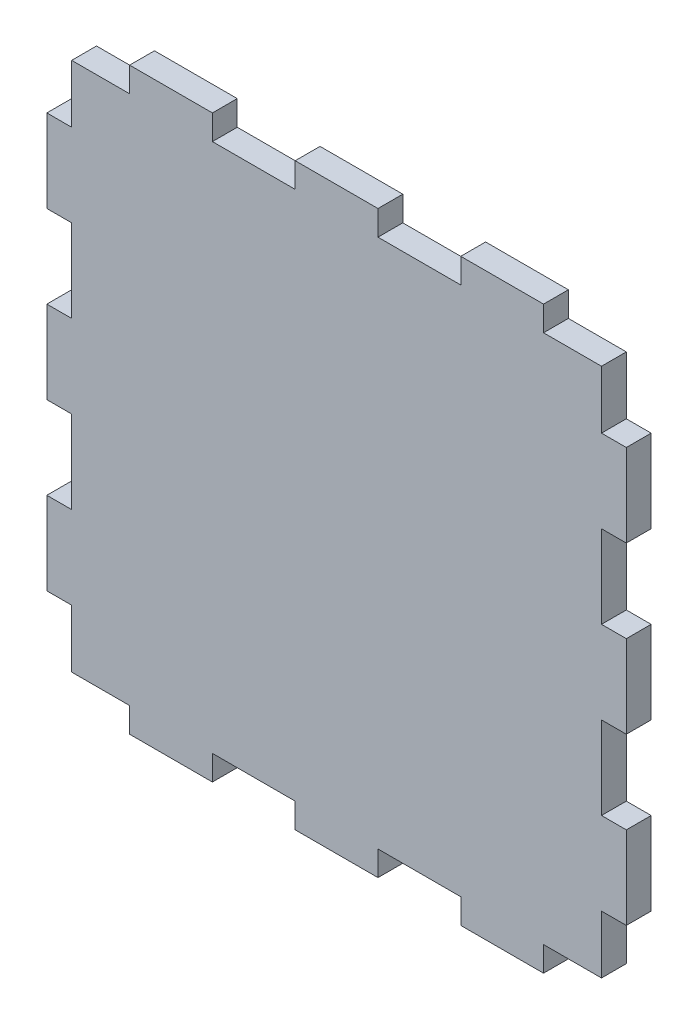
ISO-10303-21;
HEADER;
FILE_DESCRIPTION(('STEP AP214'),'2;1');
FILE_NAME('part.step','',(''),(''),'','','');
FILE_SCHEMA(('AUTOMOTIVE_DESIGN { 1 0 10303 214 1 1 1 1 }'));
ENDSEC;
DATA;
#1=APPLICATION_CONTEXT('core data for automotive mechanical design processes');
#2=APPLICATION_PROTOCOL_DEFINITION('international standard','automotive_design',2000,#1);
#3=PRODUCT_CONTEXT('',#1,'mechanical');
#4=PRODUCT('Part','Part','',(#3));
#5=PRODUCT_RELATED_PRODUCT_CATEGORY('part','',(#4));
#6=PRODUCT_DEFINITION_FORMATION('','',#4);
#7=PRODUCT_DEFINITION_CONTEXT('part definition',#1,'design');
#8=PRODUCT_DEFINITION('design','',#6,#7);
#9=PRODUCT_DEFINITION_SHAPE('','',#8);
#10=(LENGTH_UNIT() NAMED_UNIT(*) SI_UNIT(.MILLI.,.METRE.));
#11=(NAMED_UNIT(*) PLANE_ANGLE_UNIT() SI_UNIT($,.RADIAN.));
#12=(NAMED_UNIT(*) SI_UNIT($,.STERADIAN.) SOLID_ANGLE_UNIT());
#13=UNCERTAINTY_MEASURE_WITH_UNIT(LENGTH_MEASURE(1.E-05),#10,'distance_accuracy_value','');
#14=(GEOMETRIC_REPRESENTATION_CONTEXT(3) GLOBAL_UNCERTAINTY_ASSIGNED_CONTEXT((#13)) GLOBAL_UNIT_ASSIGNED_CONTEXT((#10,
#11,#12)) REPRESENTATION_CONTEXT('',''));
#15=CARTESIAN_POINT('',(0.,0.,0.));
#16=DIRECTION('',(0.,0.,1.));
#17=DIRECTION('',(1.,0.,0.));
#18=AXIS2_PLACEMENT_3D('',#15,#16,#17);
#19=CARTESIAN_POINT('',(70.,0.,3.));
#20=DIRECTION('',(-1.,0.,0.));
#21=DIRECTION('',(0.,-1.,0.));
#22=AXIS2_PLACEMENT_3D('',#19,#20,#21);
#23=PLANE('',#22);
#24=DIRECTION('',(0.,1.,0.));
#25=VECTOR('',#24,1.);
#26=CARTESIAN_POINT('',(70.,0.,3.));
#27=LINE('',#26,#25);
#28=CARTESIAN_POINT('',(70.,-20.,3.));
#29=VERTEX_POINT('',#28);
#30=CARTESIAN_POINT('',(70.,-10.,3.));
#31=VERTEX_POINT('',#30);
#32=EDGE_CURVE('E607',#29,#31,#27,.T.);
#33=ORIENTED_EDGE('',*,*,#32,.F.);
#34=DIRECTION('',(0.,0.,1.));
#35=VECTOR('',#34,1.);
#36=CARTESIAN_POINT('',(70.,-20.,-30.));
#37=LINE('',#36,#35);
#38=CARTESIAN_POINT('',(70.,-20.,0.));
#39=VERTEX_POINT('',#38);
#40=EDGE_CURVE('E374',#39,#29,#37,.T.);
#41=ORIENTED_EDGE('',*,*,#40,.F.);
#42=DIRECTION('',(0.,1.,0.));
#43=VECTOR('',#42,1.);
#44=CARTESIAN_POINT('',(70.,0.,0.));
#45=LINE('',#44,#43);
#46=CARTESIAN_POINT('',(70.,-10.,0.));
#47=VERTEX_POINT('',#46);
#48=EDGE_CURVE('E624',#39,#47,#45,.T.);
#49=ORIENTED_EDGE('',*,*,#48,.T.);
#50=DIRECTION('',(0.,0.,1.));
#51=VECTOR('',#50,1.);
#52=CARTESIAN_POINT('',(70.,-10.,-30.));
#53=LINE('',#52,#51);
#54=EDGE_CURVE('E422',#47,#31,#53,.T.);
#55=ORIENTED_EDGE('',*,*,#54,.T.);
#56=EDGE_LOOP('',(#33,#41,#49,#55));
#57=FACE_BOUND('',#56,.T.);
#58=ADVANCED_FACE('F32',(#57),#23,.F.);
#59=CARTESIAN_POINT('',(70.,-40.,0.));
#60=VERTEX_POINT('',#59);
#61=CARTESIAN_POINT('',(70.,-30.,0.));
#62=VERTEX_POINT('',#61);
#63=EDGE_CURVE('E627',#60,#62,#45,.T.);
#64=ORIENTED_EDGE('',*,*,#63,.T.);
#65=DIRECTION('',(0.,0.,1.));
#66=VECTOR('',#65,1.);
#67=CARTESIAN_POINT('',(70.,-30.,-30.));
#68=LINE('',#67,#66);
#69=CARTESIAN_POINT('',(70.,-30.,3.));
#70=VERTEX_POINT('',#69);
#71=EDGE_CURVE('E386',#62,#70,#68,.T.);
#72=ORIENTED_EDGE('',*,*,#71,.T.);
#73=CARTESIAN_POINT('',(70.,-40.,3.));
#74=VERTEX_POINT('',#73);
#75=EDGE_CURVE('E610',#74,#70,#27,.T.);
#76=ORIENTED_EDGE('',*,*,#75,.F.);
#77=DIRECTION('',(0.,0.,1.));
#78=VECTOR('',#77,1.);
#79=CARTESIAN_POINT('',(70.,-40.,-30.));
#80=LINE('',#79,#78);
#81=EDGE_CURVE('E377',#60,#74,#80,.T.);
#82=ORIENTED_EDGE('',*,*,#81,.F.);
#83=EDGE_LOOP('',(#64,#72,#76,#82));
#84=FACE_BOUND('',#83,.T.);
#85=ADVANCED_FACE('F751',(#84),#23,.F.);
#86=CARTESIAN_POINT('',(0.,0.,3.));
#87=DIRECTION('',(1.,0.,0.));
#88=DIRECTION('',(0.,1.,0.));
#89=AXIS2_PLACEMENT_3D('',#86,#87,#88);
#90=PLANE('',#89);
#91=DIRECTION('',(0.,-1.,0.));
#92=VECTOR('',#91,1.);
#93=CARTESIAN_POINT('',(0.,0.,0.));
#94=LINE('',#93,#92);
#95=CARTESIAN_POINT('',(0.,-10.,0.));
#96=VERTEX_POINT('',#95);
#97=CARTESIAN_POINT('',(0.,-20.,0.));
#98=VERTEX_POINT('',#97);
#99=EDGE_CURVE('E616',#96,#98,#94,.T.);
#100=ORIENTED_EDGE('',*,*,#99,.T.);
#101=DIRECTION('',(0.,0.,1.));
#102=VECTOR('',#101,1.);
#103=CARTESIAN_POINT('',(0.,-20.,-30.));
#104=LINE('',#103,#102);
#105=CARTESIAN_POINT('',(0.,-20.,3.));
#106=VERTEX_POINT('',#105);
#107=EDGE_CURVE('E440',#98,#106,#104,.T.);
#108=ORIENTED_EDGE('',*,*,#107,.T.);
#109=DIRECTION('',(0.,-1.,0.));
#110=VECTOR('',#109,1.);
#111=CARTESIAN_POINT('',(0.,0.,3.));
#112=LINE('',#111,#110);
#113=CARTESIAN_POINT('',(0.,-10.,3.));
#114=VERTEX_POINT('',#113);
#115=EDGE_CURVE('E598',#114,#106,#112,.T.);
#116=ORIENTED_EDGE('',*,*,#115,.F.);
#117=DIRECTION('',(0.,0.,1.));
#118=VECTOR('',#117,1.);
#119=CARTESIAN_POINT('',(0.,-10.,-30.));
#120=LINE('',#119,#118);
#121=EDGE_CURVE('E481',#96,#114,#120,.T.);
#122=ORIENTED_EDGE('',*,*,#121,.F.);
#123=EDGE_LOOP('',(#100,#108,#116,#122));
#124=FACE_BOUND('',#123,.T.);
#125=ADVANCED_FACE('F787',(#124),#90,.F.);
#126=CARTESIAN_POINT('',(0.,-30.,3.));
#127=VERTEX_POINT('',#126);
#128=CARTESIAN_POINT('',(0.,-40.,3.));
#129=VERTEX_POINT('',#128);
#130=EDGE_CURVE('E602',#127,#129,#112,.T.);
#131=ORIENTED_EDGE('',*,*,#130,.F.);
#132=DIRECTION('',(0.,0.,1.));
#133=VECTOR('',#132,1.);
#134=CARTESIAN_POINT('',(0.,-30.,-30.));
#135=LINE('',#134,#133);
#136=CARTESIAN_POINT('',(0.,-30.,0.));
#137=VERTEX_POINT('',#136);
#138=EDGE_CURVE('E439',#137,#127,#135,.T.);
#139=ORIENTED_EDGE('',*,*,#138,.F.);
#140=CARTESIAN_POINT('',(0.,-40.,0.));
#141=VERTEX_POINT('',#140);
#142=EDGE_CURVE('E620',#137,#141,#94,.T.);
#143=ORIENTED_EDGE('',*,*,#142,.T.);
#144=DIRECTION('',(0.,0.,1.));
#145=VECTOR('',#144,1.);
#146=CARTESIAN_POINT('',(0.,-40.,-30.));
#147=LINE('',#146,#145);
#148=EDGE_CURVE('E434',#141,#129,#147,.T.);
#149=ORIENTED_EDGE('',*,*,#148,.T.);
#150=EDGE_LOOP('',(#131,#139,#143,#149));
#151=FACE_BOUND('',#150,.T.);
#152=ADVANCED_FACE('F806',(#151),#90,.F.);
#153=CARTESIAN_POINT('',(0.,-70.,3.));
#154=DIRECTION('',(0.,1.,0.));
#155=DIRECTION('',(0.,0.,1.));
#156=AXIS2_PLACEMENT_3D('',#153,#154,#155);
#157=PLANE('',#156);
#158=DIRECTION('',(1.,0.,0.));
#159=VECTOR('',#158,1.);
#160=CARTESIAN_POINT('',(0.,-70.,0.));
#161=LINE('',#160,#159);
#162=CARTESIAN_POINT('',(10.,-70.,0.));
#163=VERTEX_POINT('',#162);
#164=CARTESIAN_POINT('',(20.,-70.,0.));
#165=VERTEX_POINT('',#164);
#166=EDGE_CURVE('E621',#163,#165,#161,.T.);
#167=ORIENTED_EDGE('',*,*,#166,.T.);
#168=DIRECTION('',(0.,0.,1.));
#169=VECTOR('',#168,1.);
#170=CARTESIAN_POINT('',(20.,-70.,-30.));
#171=LINE('',#170,#169);
#172=CARTESIAN_POINT('',(20.,-70.,3.));
#173=VERTEX_POINT('',#172);
#174=EDGE_CURVE('E498',#165,#173,#171,.T.);
#175=ORIENTED_EDGE('',*,*,#174,.T.);
#176=DIRECTION('',(1.,0.,0.));
#177=VECTOR('',#176,1.);
#178=CARTESIAN_POINT('',(0.,-70.,3.));
#179=LINE('',#178,#177);
#180=CARTESIAN_POINT('',(10.,-70.,3.));
#181=VERTEX_POINT('',#180);
#182=EDGE_CURVE('E604',#181,#173,#179,.T.);
#183=ORIENTED_EDGE('',*,*,#182,.F.);
#184=DIRECTION('',(0.,0.,1.));
#185=VECTOR('',#184,1.);
#186=CARTESIAN_POINT('',(10.,-70.,-30.));
#187=LINE('',#186,#185);
#188=EDGE_CURVE('E538',#163,#181,#187,.T.);
#189=ORIENTED_EDGE('',*,*,#188,.F.);
#190=EDGE_LOOP('',(#167,#175,#183,#189));
#191=FACE_BOUND('',#190,.T.);
#192=ADVANCED_FACE('F800',(#191),#157,.F.);
#193=CARTESIAN_POINT('',(30.,-70.,3.));
#194=VERTEX_POINT('',#193);
#195=CARTESIAN_POINT('',(40.,-70.,3.));
#196=VERTEX_POINT('',#195);
#197=EDGE_CURVE('E608',#194,#196,#179,.T.);
#198=ORIENTED_EDGE('',*,*,#197,.F.);
#199=DIRECTION('',(0.,0.,1.));
#200=VECTOR('',#199,1.);
#201=CARTESIAN_POINT('',(30.,-70.,-30.));
#202=LINE('',#201,#200);
#203=CARTESIAN_POINT('',(30.,-70.,0.));
#204=VERTEX_POINT('',#203);
#205=EDGE_CURVE('E504',#204,#194,#202,.T.);
#206=ORIENTED_EDGE('',*,*,#205,.F.);
#207=CARTESIAN_POINT('',(40.,-70.,0.));
#208=VERTEX_POINT('',#207);
#209=EDGE_CURVE('E625',#204,#208,#161,.T.);
#210=ORIENTED_EDGE('',*,*,#209,.T.);
#211=DIRECTION('',(0.,0.,1.));
#212=VECTOR('',#211,1.);
#213=CARTESIAN_POINT('',(40.,-70.,-30.));
#214=LINE('',#213,#212);
#215=EDGE_CURVE('E517',#208,#196,#214,.T.);
#216=ORIENTED_EDGE('',*,*,#215,.T.);
#217=EDGE_LOOP('',(#198,#206,#210,#216));
#218=FACE_BOUND('',#217,.T.);
#219=ADVANCED_FACE('F801',(#218),#157,.F.);
#220=CARTESIAN_POINT('',(0.,0.,3.));
#221=DIRECTION('',(0.,-1.,0.));
#222=DIRECTION('',(0.,0.,-1.));
#223=AXIS2_PLACEMENT_3D('',#220,#221,#222);
#224=PLANE('',#223);
#225=DIRECTION('',(-1.,0.,0.));
#226=VECTOR('',#225,1.);
#227=CARTESIAN_POINT('',(0.,0.,0.));
#228=LINE('',#227,#226);
#229=CARTESIAN_POINT('',(40.,0.,0.));
#230=VERTEX_POINT('',#229);
#231=CARTESIAN_POINT('',(30.,0.,0.));
#232=VERTEX_POINT('',#231);
#233=EDGE_CURVE('E631',#230,#232,#228,.T.);
#234=ORIENTED_EDGE('',*,*,#233,.T.);
#235=DIRECTION('',(0.,0.,1.));
#236=VECTOR('',#235,1.);
#237=CARTESIAN_POINT('',(30.,0.,-30.));
#238=LINE('',#237,#236);
#239=CARTESIAN_POINT('',(30.,0.,3.));
#240=VERTEX_POINT('',#239);
#241=EDGE_CURVE('E553',#232,#240,#238,.T.);
#242=ORIENTED_EDGE('',*,*,#241,.T.);
#243=DIRECTION('',(-1.,0.,0.));
#244=VECTOR('',#243,1.);
#245=CARTESIAN_POINT('',(0.,0.,3.));
#246=LINE('',#245,#244);
#247=CARTESIAN_POINT('',(40.,0.,3.));
#248=VERTEX_POINT('',#247);
#249=EDGE_CURVE('E614',#248,#240,#246,.T.);
#250=ORIENTED_EDGE('',*,*,#249,.F.);
#251=DIRECTION('',(0.,0.,1.));
#252=VECTOR('',#251,1.);
#253=CARTESIAN_POINT('',(40.,0.,-30.));
#254=LINE('',#253,#252);
#255=EDGE_CURVE('E571',#230,#248,#254,.T.);
#256=ORIENTED_EDGE('',*,*,#255,.F.);
#257=EDGE_LOOP('',(#234,#242,#250,#256));
#258=FACE_BOUND('',#257,.T.);
#259=ADVANCED_FACE('F797',(#258),#224,.F.);
#260=CARTESIAN_POINT('',(60.,0.,0.));
#261=VERTEX_POINT('',#260);
#262=CARTESIAN_POINT('',(50.,0.,0.));
#263=VERTEX_POINT('',#262);
#264=EDGE_CURVE('E632',#261,#263,#228,.T.);
#265=ORIENTED_EDGE('',*,*,#264,.T.);
#266=DIRECTION('',(0.,0.,1.));
#267=VECTOR('',#266,1.);
#268=CARTESIAN_POINT('',(50.,0.,-30.));
#269=LINE('',#268,#267);
#270=CARTESIAN_POINT('',(50.,0.,3.));
#271=VERTEX_POINT('',#270);
#272=EDGE_CURVE('E547',#263,#271,#269,.T.);
#273=ORIENTED_EDGE('',*,*,#272,.T.);
#274=CARTESIAN_POINT('',(60.,0.,3.));
#275=VERTEX_POINT('',#274);
#276=EDGE_CURVE('E615',#275,#271,#246,.T.);
#277=ORIENTED_EDGE('',*,*,#276,.F.);
#278=DIRECTION('',(0.,0.,1.));
#279=VECTOR('',#278,1.);
#280=CARTESIAN_POINT('',(60.,0.,-30.));
#281=LINE('',#280,#279);
#282=EDGE_CURVE('E584',#261,#275,#281,.T.);
#283=ORIENTED_EDGE('',*,*,#282,.F.);
#284=EDGE_LOOP('',(#265,#273,#277,#283));
#285=FACE_BOUND('',#284,.T.);
#286=ADVANCED_FACE('F798',(#285),#224,.F.);
#287=CARTESIAN_POINT('',(0.,-50.,3.));
#288=VERTEX_POINT('',#287);
#289=CARTESIAN_POINT('',(0.,-60.,3.));
#290=VERTEX_POINT('',#289);
#291=EDGE_CURVE('E603',#288,#290,#112,.T.);
#292=ORIENTED_EDGE('',*,*,#291,.F.);
#293=DIRECTION('',(0.,0.,1.));
#294=VECTOR('',#293,1.);
#295=CARTESIAN_POINT('',(0.,-50.,-30.));
#296=LINE('',#295,#294);
#297=CARTESIAN_POINT('',(0.,-50.,0.));
#298=VERTEX_POINT('',#297);
#299=EDGE_CURVE('E458',#298,#288,#296,.T.);
#300=ORIENTED_EDGE('',*,*,#299,.F.);
#301=CARTESIAN_POINT('',(0.,-60.,0.));
#302=VERTEX_POINT('',#301);
#303=EDGE_CURVE('E595',#298,#302,#94,.T.);
#304=ORIENTED_EDGE('',*,*,#303,.T.);
#305=DIRECTION('',(0.,0.,1.));
#306=VECTOR('',#305,1.);
#307=CARTESIAN_POINT('',(0.,-60.,-30.));
#308=LINE('',#307,#306);
#309=EDGE_CURVE('E453',#302,#290,#308,.T.);
#310=ORIENTED_EDGE('',*,*,#309,.T.);
#311=EDGE_LOOP('',(#292,#300,#304,#310));
#312=FACE_BOUND('',#311,.T.);
#313=ADVANCED_FACE('F34',(#312),#90,.F.);
#314=CARTESIAN_POINT('',(50.,-70.,3.));
#315=VERTEX_POINT('',#314);
#316=CARTESIAN_POINT('',(60.,-70.,3.));
#317=VERTEX_POINT('',#316);
#318=EDGE_CURVE('E601',#315,#317,#179,.T.);
#319=ORIENTED_EDGE('',*,*,#318,.F.);
#320=DIRECTION('',(0.,0.,1.));
#321=VECTOR('',#320,1.);
#322=CARTESIAN_POINT('',(50.,-70.,-30.));
#323=LINE('',#322,#321);
#324=CARTESIAN_POINT('',(50.,-70.,0.));
#325=VERTEX_POINT('',#324);
#326=EDGE_CURVE('E521',#325,#315,#323,.T.);
#327=ORIENTED_EDGE('',*,*,#326,.F.);
#328=CARTESIAN_POINT('',(60.,-70.,0.));
#329=VERTEX_POINT('',#328);
#330=EDGE_CURVE('E619',#325,#329,#161,.T.);
#331=ORIENTED_EDGE('',*,*,#330,.T.);
#332=DIRECTION('',(0.,0.,1.));
#333=VECTOR('',#332,1.);
#334=CARTESIAN_POINT('',(60.,-70.,-30.));
#335=LINE('',#334,#333);
#336=EDGE_CURVE('E528',#329,#317,#335,.T.);
#337=ORIENTED_EDGE('',*,*,#336,.T.);
#338=EDGE_LOOP('',(#319,#327,#331,#337));
#339=FACE_BOUND('',#338,.T.);
#340=ADVANCED_FACE('F791',(#339),#157,.F.);
#341=CARTESIAN_POINT('',(70.,-60.,0.));
#342=VERTEX_POINT('',#341);
#343=CARTESIAN_POINT('',(70.,-50.,0.));
#344=VERTEX_POINT('',#343);
#345=EDGE_CURVE('E628',#342,#344,#45,.T.);
#346=ORIENTED_EDGE('',*,*,#345,.T.);
#347=DIRECTION('',(0.,0.,1.));
#348=VECTOR('',#347,1.);
#349=CARTESIAN_POINT('',(70.,-50.,-30.));
#350=LINE('',#349,#348);
#351=CARTESIAN_POINT('',(70.,-50.,3.));
#352=VERTEX_POINT('',#351);
#353=EDGE_CURVE('E400',#344,#352,#350,.T.);
#354=ORIENTED_EDGE('',*,*,#353,.T.);
#355=CARTESIAN_POINT('',(70.,-60.,3.));
#356=VERTEX_POINT('',#355);
#357=EDGE_CURVE('E611',#356,#352,#27,.T.);
#358=ORIENTED_EDGE('',*,*,#357,.F.);
#359=DIRECTION('',(0.,0.,1.));
#360=VECTOR('',#359,1.);
#361=CARTESIAN_POINT('',(70.,-60.,-30.));
#362=LINE('',#361,#360);
#363=EDGE_CURVE('E394',#342,#356,#362,.T.);
#364=ORIENTED_EDGE('',*,*,#363,.F.);
#365=EDGE_LOOP('',(#346,#354,#358,#364));
#366=FACE_BOUND('',#365,.T.);
#367=ADVANCED_FACE('F757',(#366),#23,.F.);
#368=CARTESIAN_POINT('',(20.,0.,3.));
#369=VERTEX_POINT('',#368);
#370=CARTESIAN_POINT('',(10.,0.,3.));
#371=VERTEX_POINT('',#370);
#372=EDGE_CURVE('E612',#369,#371,#246,.T.);
#373=ORIENTED_EDGE('',*,*,#372,.F.);
#374=DIRECTION('',(0.,0.,1.));
#375=VECTOR('',#374,1.);
#376=CARTESIAN_POINT('',(20.,0.,-30.));
#377=LINE('',#376,#375);
#378=CARTESIAN_POINT('',(20.,0.,0.));
#379=VERTEX_POINT('',#378);
#380=EDGE_CURVE('E552',#379,#369,#377,.T.);
#381=ORIENTED_EDGE('',*,*,#380,.F.);
#382=CARTESIAN_POINT('',(10.,0.,0.));
#383=VERTEX_POINT('',#382);
#384=EDGE_CURVE('E629',#379,#383,#228,.T.);
#385=ORIENTED_EDGE('',*,*,#384,.T.);
#386=DIRECTION('',(0.,0.,1.));
#387=VECTOR('',#386,1.);
#388=CARTESIAN_POINT('',(10.,0.,-30.));
#389=LINE('',#388,#387);
#390=EDGE_CURVE('E592',#383,#371,#389,.T.);
#391=ORIENTED_EDGE('',*,*,#390,.T.);
#392=EDGE_LOOP('',(#373,#381,#385,#391));
#393=FACE_BOUND('',#392,.T.);
#394=ADVANCED_FACE('F790',(#393),#224,.F.);
#395=CARTESIAN_POINT('',(0.,0.,3.));
#396=DIRECTION('',(0.,0.,1.));
#397=DIRECTION('',(1.,0.,0.));
#398=AXIS2_PLACEMENT_3D('',#395,#396,#397);
#399=PLANE('',#398);
#400=DIRECTION('',(-1.,0.,0.));
#401=VECTOR('',#400,1.);
#402=CARTESIAN_POINT('',(70.,-20.,3.));
#403=LINE('',#402,#401);
#404=CARTESIAN_POINT('',(67.,-20.,3.));
#405=VERTEX_POINT('',#404);
#406=EDGE_CURVE('E371',#29,#405,#403,.T.);
#407=ORIENTED_EDGE('',*,*,#406,.F.);
#408=ORIENTED_EDGE('',*,*,#32,.T.);
#409=DIRECTION('',(1.,0.,0.));
#410=VECTOR('',#409,1.);
#411=CARTESIAN_POINT('',(70.,-10.,3.));
#412=LINE('',#411,#410);
#413=CARTESIAN_POINT('',(67.,-10.,3.));
#414=VERTEX_POINT('',#413);
#415=EDGE_CURVE('E418',#414,#31,#412,.T.);
#416=ORIENTED_EDGE('',*,*,#415,.F.);
#417=DIRECTION('',(0.,-1.,0.));
#418=VECTOR('',#417,1.);
#419=CARTESIAN_POINT('',(67.,0.,3.));
#420=LINE('',#419,#418);
#421=CARTESIAN_POINT('',(67.,-3.,3.));
#422=VERTEX_POINT('',#421);
#423=EDGE_CURVE('E415',#422,#414,#420,.T.);
#424=ORIENTED_EDGE('',*,*,#423,.F.);
#425=DIRECTION('',(1.,0.,0.));
#426=VECTOR('',#425,1.);
#427=CARTESIAN_POINT('',(60.,-3.,3.));
#428=LINE('',#427,#426);
#429=CARTESIAN_POINT('',(60.,-3.,3.));
#430=VERTEX_POINT('',#429);
#431=EDGE_CURVE('E581',#430,#422,#428,.T.);
#432=ORIENTED_EDGE('',*,*,#431,.F.);
#433=DIRECTION('',(0.,-1.,0.));
#434=VECTOR('',#433,1.);
#435=CARTESIAN_POINT('',(60.,0.,3.));
#436=LINE('',#435,#434);
#437=EDGE_CURVE('E541',#275,#430,#436,.T.);
#438=ORIENTED_EDGE('',*,*,#437,.F.);
#439=ORIENTED_EDGE('',*,*,#276,.T.);
#440=DIRECTION('',(0.,1.,0.));
#441=VECTOR('',#440,1.);
#442=CARTESIAN_POINT('',(50.,0.,3.));
#443=LINE('',#442,#441);
#444=CARTESIAN_POINT('',(50.,-3.,3.));
#445=VERTEX_POINT('',#444);
#446=EDGE_CURVE('E569',#445,#271,#443,.T.);
#447=ORIENTED_EDGE('',*,*,#446,.F.);
#448=DIRECTION('',(1.,0.,0.));
#449=VECTOR('',#448,1.);
#450=CARTESIAN_POINT('',(40.,-3.,3.));
#451=LINE('',#450,#449);
#452=CARTESIAN_POINT('',(40.,-3.,3.));
#453=VERTEX_POINT('',#452);
#454=EDGE_CURVE('E565',#453,#445,#451,.T.);
#455=ORIENTED_EDGE('',*,*,#454,.F.);
#456=DIRECTION('',(0.,-1.,0.));
#457=VECTOR('',#456,1.);
#458=CARTESIAN_POINT('',(40.,0.,3.));
#459=LINE('',#458,#457);
#460=EDGE_CURVE('E562',#248,#453,#459,.T.);
#461=ORIENTED_EDGE('',*,*,#460,.F.);
#462=ORIENTED_EDGE('',*,*,#249,.T.);
#463=DIRECTION('',(0.,1.,0.));
#464=VECTOR('',#463,1.);
#465=CARTESIAN_POINT('',(30.,0.,3.));
#466=LINE('',#465,#464);
#467=CARTESIAN_POINT('',(30.,-3.,3.));
#468=VERTEX_POINT('',#467);
#469=EDGE_CURVE('E550',#468,#240,#466,.T.);
#470=ORIENTED_EDGE('',*,*,#469,.F.);
#471=DIRECTION('',(1.,0.,0.));
#472=VECTOR('',#471,1.);
#473=CARTESIAN_POINT('',(20.,-3.,3.));
#474=LINE('',#473,#472);
#475=CARTESIAN_POINT('',(20.,-3.,3.));
#476=VERTEX_POINT('',#475);
#477=EDGE_CURVE('E546',#476,#468,#474,.T.);
#478=ORIENTED_EDGE('',*,*,#477,.F.);
#479=DIRECTION('',(0.,-1.,0.));
#480=VECTOR('',#479,1.);
#481=CARTESIAN_POINT('',(20.,0.,3.));
#482=LINE('',#481,#480);
#483=EDGE_CURVE('E543',#369,#476,#482,.T.);
#484=ORIENTED_EDGE('',*,*,#483,.F.);
#485=ORIENTED_EDGE('',*,*,#372,.T.);
#486=DIRECTION('',(0.,1.,0.));
#487=VECTOR('',#486,1.);
#488=CARTESIAN_POINT('',(10.,0.,3.));
#489=LINE('',#488,#487);
#490=CARTESIAN_POINT('',(10.,-3.,3.));
#491=VERTEX_POINT('',#490);
#492=EDGE_CURVE('E588',#491,#371,#489,.T.);
#493=ORIENTED_EDGE('',*,*,#492,.F.);
#494=DIRECTION('',(1.,0.,0.));
#495=VECTOR('',#494,1.);
#496=CARTESIAN_POINT('',(0.,-3.,3.));
#497=LINE('',#496,#495);
#498=CARTESIAN_POINT('',(3.,-3.,3.));
#499=VERTEX_POINT('',#498);
#500=EDGE_CURVE('E556',#499,#491,#497,.T.);
#501=ORIENTED_EDGE('',*,*,#500,.F.);
#502=DIRECTION('',(0.,1.,0.));
#503=VECTOR('',#502,1.);
#504=CARTESIAN_POINT('',(3.,0.,3.));
#505=LINE('',#504,#503);
#506=CARTESIAN_POINT('',(3.,-10.,3.));
#507=VERTEX_POINT('',#506);
#508=EDGE_CURVE('E479',#507,#499,#505,.T.);
#509=ORIENTED_EDGE('',*,*,#508,.F.);
#510=DIRECTION('',(1.,0.,0.));
#511=VECTOR('',#510,1.);
#512=CARTESIAN_POINT('',(0.,-10.,3.));
#513=LINE('',#512,#511);
#514=EDGE_CURVE('E476',#114,#507,#513,.T.);
#515=ORIENTED_EDGE('',*,*,#514,.F.);
#516=ORIENTED_EDGE('',*,*,#115,.T.);
#517=DIRECTION('',(-1.,0.,0.));
#518=VECTOR('',#517,1.);
#519=CARTESIAN_POINT('',(0.,-20.,3.));
#520=LINE('',#519,#518);
#521=CARTESIAN_POINT('',(3.,-20.,3.));
#522=VERTEX_POINT('',#521);
#523=EDGE_CURVE('E437',#522,#106,#520,.T.);
#524=ORIENTED_EDGE('',*,*,#523,.F.);
#525=DIRECTION('',(0.,1.,0.));
#526=VECTOR('',#525,1.);
#527=CARTESIAN_POINT('',(3.,-20.,3.));
#528=LINE('',#527,#526);
#529=CARTESIAN_POINT('',(3.,-30.,3.));
#530=VERTEX_POINT('',#529);
#531=EDGE_CURVE('E433',#530,#522,#528,.T.);
#532=ORIENTED_EDGE('',*,*,#531,.F.);
#533=DIRECTION('',(1.,0.,0.));
#534=VECTOR('',#533,1.);
#535=CARTESIAN_POINT('',(0.,-30.,3.));
#536=LINE('',#535,#534);
#537=EDGE_CURVE('E430',#127,#530,#536,.T.);
#538=ORIENTED_EDGE('',*,*,#537,.F.);
#539=ORIENTED_EDGE('',*,*,#130,.T.);
#540=DIRECTION('',(-1.,0.,0.));
#541=VECTOR('',#540,1.);
#542=CARTESIAN_POINT('',(0.,-40.,3.));
#543=LINE('',#542,#541);
#544=CARTESIAN_POINT('',(3.,-40.,3.));
#545=VERTEX_POINT('',#544);
#546=EDGE_CURVE('E456',#545,#129,#543,.T.);
#547=ORIENTED_EDGE('',*,*,#546,.F.);
#548=DIRECTION('',(0.,1.,0.));
#549=VECTOR('',#548,1.);
#550=CARTESIAN_POINT('',(3.,-40.,3.));
#551=LINE('',#550,#549);
#552=CARTESIAN_POINT('',(3.,-50.,3.));
#553=VERTEX_POINT('',#552);
#554=EDGE_CURVE('E452',#553,#545,#551,.T.);
#555=ORIENTED_EDGE('',*,*,#554,.F.);
#556=DIRECTION('',(1.,0.,0.));
#557=VECTOR('',#556,1.);
#558=CARTESIAN_POINT('',(0.,-50.,3.));
#559=LINE('',#558,#557);
#560=EDGE_CURVE('E449',#288,#553,#559,.T.);
#561=ORIENTED_EDGE('',*,*,#560,.F.);
#562=ORIENTED_EDGE('',*,*,#291,.T.);
#563=DIRECTION('',(-1.,0.,0.));
#564=VECTOR('',#563,1.);
#565=CARTESIAN_POINT('',(0.,-60.,3.));
#566=LINE('',#565,#564);
#567=CARTESIAN_POINT('',(3.,-60.,3.));
#568=VERTEX_POINT('',#567);
#569=EDGE_CURVE('E468',#568,#290,#566,.T.);
#570=ORIENTED_EDGE('',*,*,#569,.F.);
#571=DIRECTION('',(0.,1.,0.));
#572=VECTOR('',#571,1.);
#573=CARTESIAN_POINT('',(3.,-60.,3.));
#574=LINE('',#573,#572);
#575=CARTESIAN_POINT('',(3.,-67.,3.));
#576=VERTEX_POINT('',#575);
#577=EDGE_CURVE('E429',#576,#568,#574,.T.);
#578=ORIENTED_EDGE('',*,*,#577,.F.);
#579=DIRECTION('',(-1.,0.,0.));
#580=VECTOR('',#579,1.);
#581=CARTESIAN_POINT('',(0.,-67.,3.));
#582=LINE('',#581,#580);
#583=CARTESIAN_POINT('',(10.,-67.,3.));
#584=VERTEX_POINT('',#583);
#585=EDGE_CURVE('E535',#584,#576,#582,.T.);
#586=ORIENTED_EDGE('',*,*,#585,.F.);
#587=DIRECTION('',(0.,1.,0.));
#588=VECTOR('',#587,1.);
#589=CARTESIAN_POINT('',(10.,-70.,3.));
#590=LINE('',#589,#588);
#591=EDGE_CURVE('E501',#181,#584,#590,.T.);
#592=ORIENTED_EDGE('',*,*,#591,.F.);
#593=ORIENTED_EDGE('',*,*,#182,.T.);
#594=DIRECTION('',(0.,-1.,0.));
#595=VECTOR('',#594,1.);
#596=CARTESIAN_POINT('',(20.,-70.,3.));
#597=LINE('',#596,#595);
#598=CARTESIAN_POINT('',(20.,-67.,3.));
#599=VERTEX_POINT('',#598);
#600=EDGE_CURVE('E489',#599,#173,#597,.T.);
#601=ORIENTED_EDGE('',*,*,#600,.F.);
#602=DIRECTION('',(-1.,0.,0.));
#603=VECTOR('',#602,1.);
#604=CARTESIAN_POINT('',(20.,-67.,3.));
#605=LINE('',#604,#603);
#606=CARTESIAN_POINT('',(30.,-67.,3.));
#607=VERTEX_POINT('',#606);
#608=EDGE_CURVE('E495',#607,#599,#605,.T.);
#609=ORIENTED_EDGE('',*,*,#608,.F.);
#610=DIRECTION('',(0.,1.,0.));
#611=VECTOR('',#610,1.);
#612=CARTESIAN_POINT('',(30.,-70.,3.));
#613=LINE('',#612,#611);
#614=EDGE_CURVE('E491',#194,#607,#613,.T.);
#615=ORIENTED_EDGE('',*,*,#614,.F.);
#616=ORIENTED_EDGE('',*,*,#197,.T.);
#617=DIRECTION('',(0.,-1.,0.));
#618=VECTOR('',#617,1.);
#619=CARTESIAN_POINT('',(40.,-70.,3.));
#620=LINE('',#619,#618);
#621=CARTESIAN_POINT('',(40.,-67.,3.));
#622=VERTEX_POINT('',#621);
#623=EDGE_CURVE('E508',#622,#196,#620,.T.);
#624=ORIENTED_EDGE('',*,*,#623,.F.);
#625=DIRECTION('',(-1.,0.,0.));
#626=VECTOR('',#625,1.);
#627=CARTESIAN_POINT('',(40.,-67.,3.));
#628=LINE('',#627,#626);
#629=CARTESIAN_POINT('',(50.,-67.,3.));
#630=VERTEX_POINT('',#629);
#631=EDGE_CURVE('E514',#630,#622,#628,.T.);
#632=ORIENTED_EDGE('',*,*,#631,.F.);
#633=DIRECTION('',(0.,1.,0.));
#634=VECTOR('',#633,1.);
#635=CARTESIAN_POINT('',(50.,-70.,3.));
#636=LINE('',#635,#634);
#637=EDGE_CURVE('E510',#315,#630,#636,.T.);
#638=ORIENTED_EDGE('',*,*,#637,.F.);
#639=ORIENTED_EDGE('',*,*,#318,.T.);
#640=DIRECTION('',(0.,-1.,0.));
#641=VECTOR('',#640,1.);
#642=CARTESIAN_POINT('',(60.,-70.,3.));
#643=LINE('',#642,#641);
#644=CARTESIAN_POINT('',(60.,-67.,3.));
#645=VERTEX_POINT('',#644);
#646=EDGE_CURVE('E488',#645,#317,#643,.T.);
#647=ORIENTED_EDGE('',*,*,#646,.F.);
#648=DIRECTION('',(-1.,0.,0.));
#649=VECTOR('',#648,1.);
#650=CARTESIAN_POINT('',(60.,-67.,3.));
#651=LINE('',#650,#649);
#652=CARTESIAN_POINT('',(67.,-67.,3.));
#653=VERTEX_POINT('',#652);
#654=EDGE_CURVE('E526',#653,#645,#651,.T.);
#655=ORIENTED_EDGE('',*,*,#654,.F.);
#656=DIRECTION('',(0.,-1.,0.));
#657=VECTOR('',#656,1.);
#658=CARTESIAN_POINT('',(67.,-60.,3.));
#659=LINE('',#658,#657);
#660=CARTESIAN_POINT('',(67.,-60.,3.));
#661=VERTEX_POINT('',#660);
#662=EDGE_CURVE('E408',#661,#653,#659,.T.);
#663=ORIENTED_EDGE('',*,*,#662,.F.);
#664=DIRECTION('',(-1.,0.,0.));
#665=VECTOR('',#664,1.);
#666=CARTESIAN_POINT('',(70.,-60.,3.));
#667=LINE('',#666,#665);
#668=EDGE_CURVE('E405',#356,#661,#667,.T.);
#669=ORIENTED_EDGE('',*,*,#668,.F.);
#670=ORIENTED_EDGE('',*,*,#357,.T.);
#671=DIRECTION('',(1.,0.,0.));
#672=VECTOR('',#671,1.);
#673=CARTESIAN_POINT('',(70.,-50.,3.));
#674=LINE('',#673,#672);
#675=CARTESIAN_POINT('',(67.,-50.,3.));
#676=VERTEX_POINT('',#675);
#677=EDGE_CURVE('E396',#676,#352,#674,.T.);
#678=ORIENTED_EDGE('',*,*,#677,.F.);
#679=DIRECTION('',(0.,-1.,0.));
#680=VECTOR('',#679,1.);
#681=CARTESIAN_POINT('',(67.,-40.,3.));
#682=LINE('',#681,#680);
#683=CARTESIAN_POINT('',(67.,-40.,3.));
#684=VERTEX_POINT('',#683);
#685=EDGE_CURVE('E393',#684,#676,#682,.T.);
#686=ORIENTED_EDGE('',*,*,#685,.F.);
#687=DIRECTION('',(-1.,0.,0.));
#688=VECTOR('',#687,1.);
#689=CARTESIAN_POINT('',(70.,-40.,3.));
#690=LINE('',#689,#688);
#691=EDGE_CURVE('E390',#74,#684,#690,.T.);
#692=ORIENTED_EDGE('',*,*,#691,.F.);
#693=ORIENTED_EDGE('',*,*,#75,.T.);
#694=DIRECTION('',(1.,0.,0.));
#695=VECTOR('',#694,1.);
#696=CARTESIAN_POINT('',(70.,-30.,3.));
#697=LINE('',#696,#695);
#698=CARTESIAN_POINT('',(67.,-30.,3.));
#699=VERTEX_POINT('',#698);
#700=EDGE_CURVE('E368',#699,#70,#697,.T.);
#701=ORIENTED_EDGE('',*,*,#700,.F.);
#702=DIRECTION('',(0.,-1.,0.));
#703=VECTOR('',#702,1.);
#704=CARTESIAN_POINT('',(67.,-20.,3.));
#705=LINE('',#704,#703);
#706=EDGE_CURVE('E363',#405,#699,#705,.T.);
#707=ORIENTED_EDGE('',*,*,#706,.F.);
#708=EDGE_LOOP('',(#407,#408,#416,#424,#432,#438,#439,#447,#455,#461,#462,#470,#478,#484,#485,
#493,#501,#509,#515,#516,#524,#532,#538,#539,#547,#555,#561,#562,#570,#578,#586,#592,#593,#601,
#609,#615,#616,#624,#632,#638,#639,#647,#655,#663,#669,#670,#678,#686,#692,#693,#701,#707));
#709=FACE_BOUND('',#708,.T.);
#710=ADVANCED_FACE('F379',(#709),#399,.T.);
#711=CARTESIAN_POINT('',(0.,0.,0.));
#712=DIRECTION('',(0.,0.,1.));
#713=DIRECTION('',(1.,0.,0.));
#714=AXIS2_PLACEMENT_3D('',#711,#712,#713);
#715=PLANE('',#714);
#716=ORIENTED_EDGE('',*,*,#48,.F.);
#717=DIRECTION('',(-1.,0.,0.));
#718=VECTOR('',#717,1.);
#719=CARTESIAN_POINT('',(0.,-20.,0.));
#720=LINE('',#719,#718);
#721=CARTESIAN_POINT('',(67.,-20.,0.));
#722=VERTEX_POINT('',#721);
#723=EDGE_CURVE('E11',#39,#722,#720,.T.);
#724=ORIENTED_EDGE('',*,*,#723,.T.);
#725=DIRECTION('',(0.,-1.,0.));
#726=VECTOR('',#725,1.);
#727=CARTESIAN_POINT('',(67.,0.,0.));
#728=LINE('',#727,#726);
#729=CARTESIAN_POINT('',(67.,-30.,0.));
#730=VERTEX_POINT('',#729);
#731=EDGE_CURVE('E366',#722,#730,#728,.T.);
#732=ORIENTED_EDGE('',*,*,#731,.T.);
#733=DIRECTION('',(1.,0.,0.));
#734=VECTOR('',#733,1.);
#735=CARTESIAN_POINT('',(0.,-30.,0.));
#736=LINE('',#735,#734);
#737=EDGE_CURVE('E40',#730,#62,#736,.T.);
#738=ORIENTED_EDGE('',*,*,#737,.T.);
#739=ORIENTED_EDGE('',*,*,#63,.F.);
#740=DIRECTION('',(-1.,0.,0.));
#741=VECTOR('',#740,1.);
#742=CARTESIAN_POINT('',(0.,-40.,0.));
#743=LINE('',#742,#741);
#744=CARTESIAN_POINT('',(67.,-40.,0.));
#745=VERTEX_POINT('',#744);
#746=EDGE_CURVE('E739',#60,#745,#743,.T.);
#747=ORIENTED_EDGE('',*,*,#746,.T.);
#748=DIRECTION('',(0.,-1.,0.));
#749=VECTOR('',#748,1.);
#750=CARTESIAN_POINT('',(67.,0.,0.));
#751=LINE('',#750,#749);
#752=CARTESIAN_POINT('',(67.,-50.,0.));
#753=VERTEX_POINT('',#752);
#754=EDGE_CURVE('E733',#745,#753,#751,.T.);
#755=ORIENTED_EDGE('',*,*,#754,.T.);
#756=DIRECTION('',(1.,0.,0.));
#757=VECTOR('',#756,1.);
#758=CARTESIAN_POINT('',(0.,-50.,0.));
#759=LINE('',#758,#757);
#760=EDGE_CURVE('E736',#753,#344,#759,.T.);
#761=ORIENTED_EDGE('',*,*,#760,.T.);
#762=ORIENTED_EDGE('',*,*,#345,.F.);
#763=DIRECTION('',(-1.,0.,0.));
#764=VECTOR('',#763,1.);
#765=CARTESIAN_POINT('',(0.,-60.,0.));
#766=LINE('',#765,#764);
#767=CARTESIAN_POINT('',(67.,-60.,0.));
#768=VERTEX_POINT('',#767);
#769=EDGE_CURVE('E730',#342,#768,#766,.T.);
#770=ORIENTED_EDGE('',*,*,#769,.T.);
#771=DIRECTION('',(0.,-1.,0.));
#772=VECTOR('',#771,1.);
#773=CARTESIAN_POINT('',(67.,0.,0.));
#774=LINE('',#773,#772);
#775=CARTESIAN_POINT('',(67.,-67.,0.));
#776=VERTEX_POINT('',#775);
#777=EDGE_CURVE('E385',#768,#776,#774,.T.);
#778=ORIENTED_EDGE('',*,*,#777,.T.);
#779=DIRECTION('',(-1.,0.,0.));
#780=VECTOR('',#779,1.);
#781=CARTESIAN_POINT('',(0.,-67.,0.));
#782=LINE('',#781,#780);
#783=CARTESIAN_POINT('',(60.,-67.,0.));
#784=VERTEX_POINT('',#783);
#785=EDGE_CURVE('E668',#776,#784,#782,.T.);
#786=ORIENTED_EDGE('',*,*,#785,.T.);
#787=DIRECTION('',(0.,-1.,0.));
#788=VECTOR('',#787,1.);
#789=CARTESIAN_POINT('',(59.9999999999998,1.38777878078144E-13,0.));
#790=LINE('',#789,#788);
#791=EDGE_CURVE('E670',#784,#329,#790,.T.);
#792=ORIENTED_EDGE('',*,*,#791,.T.);
#793=ORIENTED_EDGE('',*,*,#330,.F.);
#794=DIRECTION('',(0.,1.,0.));
#795=VECTOR('',#794,1.);
#796=CARTESIAN_POINT('',(50.,0.,0.));
#797=LINE('',#796,#795);
#798=CARTESIAN_POINT('',(50.,-67.,0.));
#799=VERTEX_POINT('',#798);
#800=EDGE_CURVE('E673',#325,#799,#797,.T.);
#801=ORIENTED_EDGE('',*,*,#800,.T.);
#802=DIRECTION('',(-1.,0.,0.));
#803=VECTOR('',#802,1.);
#804=CARTESIAN_POINT('',(0.,-67.,0.));
#805=LINE('',#804,#803);
#806=CARTESIAN_POINT('',(40.,-67.,0.));
#807=VERTEX_POINT('',#806);
#808=EDGE_CURVE('E676',#799,#807,#805,.T.);
#809=ORIENTED_EDGE('',*,*,#808,.T.);
#810=DIRECTION('',(0.,-1.,0.));
#811=VECTOR('',#810,1.);
#812=CARTESIAN_POINT('',(39.9999999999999,0.,0.));
#813=LINE('',#812,#811);
#814=EDGE_CURVE('E679',#807,#208,#813,.T.);
#815=ORIENTED_EDGE('',*,*,#814,.T.);
#816=ORIENTED_EDGE('',*,*,#209,.F.);
#817=DIRECTION('',(0.,1.,0.));
#818=VECTOR('',#817,1.);
#819=CARTESIAN_POINT('',(30.,0.,0.));
#820=LINE('',#819,#818);
#821=CARTESIAN_POINT('',(30.,-67.,0.));
#822=VERTEX_POINT('',#821);
#823=EDGE_CURVE('E682',#204,#822,#820,.T.);
#824=ORIENTED_EDGE('',*,*,#823,.T.);
#825=DIRECTION('',(-1.,0.,0.));
#826=VECTOR('',#825,1.);
#827=CARTESIAN_POINT('',(0.,-67.,0.));
#828=LINE('',#827,#826);
#829=CARTESIAN_POINT('',(20.,-67.,0.));
#830=VERTEX_POINT('',#829);
#831=EDGE_CURVE('E685',#822,#830,#828,.T.);
#832=ORIENTED_EDGE('',*,*,#831,.T.);
#833=DIRECTION('',(0.,-1.,0.));
#834=VECTOR('',#833,1.);
#835=CARTESIAN_POINT('',(19.9999999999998,0.,0.));
#836=LINE('',#835,#834);
#837=EDGE_CURVE('E688',#830,#165,#836,.T.);
#838=ORIENTED_EDGE('',*,*,#837,.T.);
#839=ORIENTED_EDGE('',*,*,#166,.F.);
#840=DIRECTION('',(0.,1.,0.));
#841=VECTOR('',#840,1.);
#842=CARTESIAN_POINT('',(10.,0.,0.));
#843=LINE('',#842,#841);
#844=CARTESIAN_POINT('',(10.,-67.,0.));
#845=VERTEX_POINT('',#844);
#846=EDGE_CURVE('E662',#163,#845,#843,.T.);
#847=ORIENTED_EDGE('',*,*,#846,.T.);
#848=DIRECTION('',(-1.,0.,0.));
#849=VECTOR('',#848,1.);
#850=CARTESIAN_POINT('',(0.,-67.,0.));
#851=LINE('',#850,#849);
#852=CARTESIAN_POINT('',(3.,-67.,0.));
#853=VERTEX_POINT('',#852);
#854=EDGE_CURVE('E665',#845,#853,#851,.T.);
#855=ORIENTED_EDGE('',*,*,#854,.T.);
#856=DIRECTION('',(0.,1.,0.));
#857=VECTOR('',#856,1.);
#858=CARTESIAN_POINT('',(2.99999999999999,0.,0.));
#859=LINE('',#858,#857);
#860=CARTESIAN_POINT('',(3.,-60.,0.));
#861=VERTEX_POINT('',#860);
#862=EDGE_CURVE('E443',#853,#861,#859,.T.);
#863=ORIENTED_EDGE('',*,*,#862,.T.);
#864=DIRECTION('',(-1.,0.,0.));
#865=VECTOR('',#864,1.);
#866=CARTESIAN_POINT('',(0.,-60.,0.));
#867=LINE('',#866,#865);
#868=EDGE_CURVE('E700',#861,#302,#867,.T.);
#869=ORIENTED_EDGE('',*,*,#868,.T.);
#870=ORIENTED_EDGE('',*,*,#303,.F.);
#871=DIRECTION('',(1.,0.,0.));
#872=VECTOR('',#871,1.);
#873=CARTESIAN_POINT('',(0.,-50.,0.));
#874=LINE('',#873,#872);
#875=CARTESIAN_POINT('',(3.,-50.,0.));
#876=VERTEX_POINT('',#875);
#877=EDGE_CURVE('E703',#298,#876,#874,.T.);
#878=ORIENTED_EDGE('',*,*,#877,.T.);
#879=DIRECTION('',(0.,1.,0.));
#880=VECTOR('',#879,1.);
#881=CARTESIAN_POINT('',(2.99999999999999,0.,0.));
#882=LINE('',#881,#880);
#883=CARTESIAN_POINT('',(3.,-40.,0.));
#884=VERTEX_POINT('',#883);
#885=EDGE_CURVE('E706',#876,#884,#882,.T.);
#886=ORIENTED_EDGE('',*,*,#885,.T.);
#887=DIRECTION('',(-1.,0.,0.));
#888=VECTOR('',#887,1.);
#889=CARTESIAN_POINT('',(0.,-40.,0.));
#890=LINE('',#889,#888);
#891=EDGE_CURVE('E709',#884,#141,#890,.T.);
#892=ORIENTED_EDGE('',*,*,#891,.T.);
#893=ORIENTED_EDGE('',*,*,#142,.F.);
#894=DIRECTION('',(1.,0.,0.));
#895=VECTOR('',#894,1.);
#896=CARTESIAN_POINT('',(0.,-30.,0.));
#897=LINE('',#896,#895);
#898=CARTESIAN_POINT('',(3.,-30.,0.));
#899=VERTEX_POINT('',#898);
#900=EDGE_CURVE('E712',#137,#899,#897,.T.);
#901=ORIENTED_EDGE('',*,*,#900,.T.);
#902=DIRECTION('',(0.,1.,0.));
#903=VECTOR('',#902,1.);
#904=CARTESIAN_POINT('',(3.,0.,0.));
#905=LINE('',#904,#903);
#906=CARTESIAN_POINT('',(3.,-20.,0.));
#907=VERTEX_POINT('',#906);
#908=EDGE_CURVE('E715',#899,#907,#905,.T.);
#909=ORIENTED_EDGE('',*,*,#908,.T.);
#910=DIRECTION('',(-1.,0.,0.));
#911=VECTOR('',#910,1.);
#912=CARTESIAN_POINT('',(0.,-20.,0.));
#913=LINE('',#912,#911);
#914=EDGE_CURVE('E718',#907,#98,#913,.T.);
#915=ORIENTED_EDGE('',*,*,#914,.T.);
#916=ORIENTED_EDGE('',*,*,#99,.F.);
#917=DIRECTION('',(1.,0.,0.));
#918=VECTOR('',#917,1.);
#919=CARTESIAN_POINT('',(0.,-10.,0.));
#920=LINE('',#919,#918);
#921=CARTESIAN_POINT('',(3.,-10.,0.));
#922=VERTEX_POINT('',#921);
#923=EDGE_CURVE('E694',#96,#922,#920,.T.);
#924=ORIENTED_EDGE('',*,*,#923,.T.);
#925=DIRECTION('',(0.,1.,0.));
#926=VECTOR('',#925,1.);
#927=CARTESIAN_POINT('',(3.,0.,0.));
#928=LINE('',#927,#926);
#929=CARTESIAN_POINT('',(3.,-3.,0.));
#930=VERTEX_POINT('',#929);
#931=EDGE_CURVE('E484',#922,#930,#928,.T.);
#932=ORIENTED_EDGE('',*,*,#931,.T.);
#933=DIRECTION('',(1.,0.,0.));
#934=VECTOR('',#933,1.);
#935=CARTESIAN_POINT('',(0.,-3.,0.));
#936=LINE('',#935,#934);
#937=CARTESIAN_POINT('',(10.,-3.,0.));
#938=VERTEX_POINT('',#937);
#939=EDGE_CURVE('E633',#930,#938,#936,.T.);
#940=ORIENTED_EDGE('',*,*,#939,.T.);
#941=DIRECTION('',(0.,1.,0.));
#942=VECTOR('',#941,1.);
#943=CARTESIAN_POINT('',(10.,0.,0.));
#944=LINE('',#943,#942);
#945=EDGE_CURVE('E635',#938,#383,#944,.T.);
#946=ORIENTED_EDGE('',*,*,#945,.T.);
#947=ORIENTED_EDGE('',*,*,#384,.F.);
#948=DIRECTION('',(0.,-1.,0.));
#949=VECTOR('',#948,1.);
#950=CARTESIAN_POINT('',(20.,0.,0.));
#951=LINE('',#950,#949);
#952=CARTESIAN_POINT('',(20.,-3.,0.));
#953=VERTEX_POINT('',#952);
#954=EDGE_CURVE('E653',#379,#953,#951,.T.);
#955=ORIENTED_EDGE('',*,*,#954,.T.);
#956=DIRECTION('',(1.,0.,0.));
#957=VECTOR('',#956,1.);
#958=CARTESIAN_POINT('',(0.,-3.,0.));
#959=LINE('',#958,#957);
#960=CARTESIAN_POINT('',(30.,-3.,0.));
#961=VERTEX_POINT('',#960);
#962=EDGE_CURVE('E656',#953,#961,#959,.T.);
#963=ORIENTED_EDGE('',*,*,#962,.T.);
#964=DIRECTION('',(0.,1.,0.));
#965=VECTOR('',#964,1.);
#966=CARTESIAN_POINT('',(30.,0.,0.));
#967=LINE('',#966,#965);
#968=EDGE_CURVE('E659',#961,#232,#967,.T.);
#969=ORIENTED_EDGE('',*,*,#968,.T.);
#970=ORIENTED_EDGE('',*,*,#233,.F.);
#971=DIRECTION('',(0.,-1.,0.));
#972=VECTOR('',#971,1.);
#973=CARTESIAN_POINT('',(40.,0.,0.));
#974=LINE('',#973,#972);
#975=CARTESIAN_POINT('',(40.,-3.,0.));
#976=VERTEX_POINT('',#975);
#977=EDGE_CURVE('E644',#230,#976,#974,.T.);
#978=ORIENTED_EDGE('',*,*,#977,.T.);
#979=DIRECTION('',(1.,0.,0.));
#980=VECTOR('',#979,1.);
#981=CARTESIAN_POINT('',(0.,-3.,0.));
#982=LINE('',#981,#980);
#983=CARTESIAN_POINT('',(50.,-3.,0.));
#984=VERTEX_POINT('',#983);
#985=EDGE_CURVE('E647',#976,#984,#982,.T.);
#986=ORIENTED_EDGE('',*,*,#985,.T.);
#987=DIRECTION('',(0.,1.,0.));
#988=VECTOR('',#987,1.);
#989=CARTESIAN_POINT('',(50.,0.,0.));
#990=LINE('',#989,#988);
#991=EDGE_CURVE('E650',#984,#263,#990,.T.);
#992=ORIENTED_EDGE('',*,*,#991,.T.);
#993=ORIENTED_EDGE('',*,*,#264,.F.);
#994=DIRECTION('',(0.,-1.,0.));
#995=VECTOR('',#994,1.);
#996=CARTESIAN_POINT('',(60.,0.,0.));
#997=LINE('',#996,#995);
#998=CARTESIAN_POINT('',(60.,-3.,0.));
#999=VERTEX_POINT('',#998);
#1000=EDGE_CURVE('E638',#261,#999,#997,.T.);
#1001=ORIENTED_EDGE('',*,*,#1000,.T.);
#1002=DIRECTION('',(1.,0.,0.));
#1003=VECTOR('',#1002,1.);
#1004=CARTESIAN_POINT('',(0.,-3.,0.));
#1005=LINE('',#1004,#1003);
#1006=CARTESIAN_POINT('',(67.,-3.,0.));
#1007=VERTEX_POINT('',#1006);
#1008=EDGE_CURVE('E641',#999,#1007,#1005,.T.);
#1009=ORIENTED_EDGE('',*,*,#1008,.T.);
#1010=DIRECTION('',(0.,-1.,0.));
#1011=VECTOR('',#1010,1.);
#1012=CARTESIAN_POINT('',(67.,0.,0.));
#1013=LINE('',#1012,#1011);
#1014=CARTESIAN_POINT('',(67.,-10.,0.));
#1015=VERTEX_POINT('',#1014);
#1016=EDGE_CURVE('E425',#1007,#1015,#1013,.T.);
#1017=ORIENTED_EDGE('',*,*,#1016,.T.);
#1018=DIRECTION('',(1.,0.,0.));
#1019=VECTOR('',#1018,1.);
#1020=CARTESIAN_POINT('',(0.,-10.,0.));
#1021=LINE('',#1020,#1019);
#1022=EDGE_CURVE('E724',#1015,#47,#1021,.T.);
#1023=ORIENTED_EDGE('',*,*,#1022,.T.);
#1024=EDGE_LOOP('',(#716,#724,#732,#738,#739,#747,#755,#761,#762,#770,#778,#786,#792,#793,#801,
#809,#815,#816,#824,#832,#838,#839,#847,#855,#863,#869,#870,#878,#886,#892,#893,#901,#909,#915,
#916,#924,#932,#940,#946,#947,#955,#963,#969,#970,#978,#986,#992,#993,#1001,#1009,#1017,#1023));
#1025=FACE_BOUND('',#1024,.T.);
#1026=ADVANCED_FACE('F747',(#1025),#715,.F.);
#1027=CARTESIAN_POINT('',(10.,0.,-30.));
#1028=DIRECTION('',(1.,0.,0.));
#1029=DIRECTION('',(0.,0.,-1.));
#1030=AXIS2_PLACEMENT_3D('',#1027,#1028,#1029);
#1031=PLANE('',#1030);
#1032=DIRECTION('',(0.,0.,1.));
#1033=VECTOR('',#1032,1.);
#1034=CARTESIAN_POINT('',(10.,-3.,-30.));
#1035=LINE('',#1034,#1033);
#1036=EDGE_CURVE('E591',#938,#491,#1035,.T.);
#1037=ORIENTED_EDGE('',*,*,#1036,.T.);
#1038=ORIENTED_EDGE('',*,*,#492,.T.);
#1039=ORIENTED_EDGE('',*,*,#390,.F.);
#1040=ORIENTED_EDGE('',*,*,#945,.F.);
#1041=EDGE_LOOP('',(#1037,#1038,#1039,#1040));
#1042=FACE_BOUND('',#1041,.T.);
#1043=ADVANCED_FACE('F967',(#1042),#1031,.F.);
#1044=CARTESIAN_POINT('',(0.,-3.,-30.));
#1045=DIRECTION('',(0.,-1.,0.));
#1046=DIRECTION('',(0.,0.,-1.));
#1047=AXIS2_PLACEMENT_3D('',#1044,#1045,#1046);
#1048=PLANE('',#1047);
#1049=ORIENTED_EDGE('',*,*,#939,.F.);
#1050=DIRECTION('',(0.,0.,1.));
#1051=VECTOR('',#1050,1.);
#1052=CARTESIAN_POINT('',(3.,-3.,-30.));
#1053=LINE('',#1052,#1051);
#1054=EDGE_CURVE('E691',#930,#499,#1053,.T.);
#1055=ORIENTED_EDGE('',*,*,#1054,.T.);
#1056=ORIENTED_EDGE('',*,*,#500,.T.);
#1057=ORIENTED_EDGE('',*,*,#1036,.F.);
#1058=EDGE_LOOP('',(#1049,#1055,#1056,#1057));
#1059=FACE_BOUND('',#1058,.T.);
#1060=ADVANCED_FACE('F962',(#1059),#1048,.F.);
#1061=CARTESIAN_POINT('',(60.,-3.,-30.));
#1062=DIRECTION('',(0.,-1.,0.));
#1063=DIRECTION('',(0.,0.,-1.));
#1064=AXIS2_PLACEMENT_3D('',#1061,#1062,#1063);
#1065=PLANE('',#1064);
#1066=ORIENTED_EDGE('',*,*,#431,.T.);
#1067=DIRECTION('',(0.,0.,-1.));
#1068=VECTOR('',#1067,1.);
#1069=CARTESIAN_POINT('',(67.,-3.,-30.));
#1070=LINE('',#1069,#1068);
#1071=EDGE_CURVE('E721',#422,#1007,#1070,.T.);
#1072=ORIENTED_EDGE('',*,*,#1071,.T.);
#1073=ORIENTED_EDGE('',*,*,#1008,.F.);
#1074=DIRECTION('',(0.,0.,1.));
#1075=VECTOR('',#1074,1.);
#1076=CARTESIAN_POINT('',(60.,-3.,-30.));
#1077=LINE('',#1076,#1075);
#1078=EDGE_CURVE('E566',#999,#430,#1077,.T.);
#1079=ORIENTED_EDGE('',*,*,#1078,.T.);
#1080=EDGE_LOOP('',(#1066,#1072,#1073,#1079));
#1081=FACE_BOUND('',#1080,.T.);
#1082=ADVANCED_FACE('F959',(#1081),#1065,.F.);
#1083=CARTESIAN_POINT('',(60.,0.,-30.));
#1084=DIRECTION('',(-1.,0.,0.));
#1085=DIRECTION('',(0.,0.,1.));
#1086=AXIS2_PLACEMENT_3D('',#1083,#1084,#1085);
#1087=PLANE('',#1086);
#1088=ORIENTED_EDGE('',*,*,#282,.T.);
#1089=ORIENTED_EDGE('',*,*,#437,.T.);
#1090=ORIENTED_EDGE('',*,*,#1078,.F.);
#1091=ORIENTED_EDGE('',*,*,#1000,.F.);
#1092=EDGE_LOOP('',(#1088,#1089,#1090,#1091));
#1093=FACE_BOUND('',#1092,.T.);
#1094=ADVANCED_FACE('F951',(#1093),#1087,.F.);
#1095=CARTESIAN_POINT('',(50.,0.,-30.));
#1096=DIRECTION('',(1.,0.,0.));
#1097=DIRECTION('',(0.,0.,-1.));
#1098=AXIS2_PLACEMENT_3D('',#1095,#1096,#1097);
#1099=PLANE('',#1098);
#1100=DIRECTION('',(0.,0.,1.));
#1101=VECTOR('',#1100,1.);
#1102=CARTESIAN_POINT('',(50.,-3.,-30.));
#1103=LINE('',#1102,#1101);
#1104=EDGE_CURVE('E574',#984,#445,#1103,.T.);
#1105=ORIENTED_EDGE('',*,*,#1104,.T.);
#1106=ORIENTED_EDGE('',*,*,#446,.T.);
#1107=ORIENTED_EDGE('',*,*,#272,.F.);
#1108=ORIENTED_EDGE('',*,*,#991,.F.);
#1109=EDGE_LOOP('',(#1105,#1106,#1107,#1108));
#1110=FACE_BOUND('',#1109,.T.);
#1111=ADVANCED_FACE('F947',(#1110),#1099,.F.);
#1112=CARTESIAN_POINT('',(40.,-3.,-30.));
#1113=DIRECTION('',(0.,-1.,0.));
#1114=DIRECTION('',(0.,0.,-1.));
#1115=AXIS2_PLACEMENT_3D('',#1112,#1113,#1114);
#1116=PLANE('',#1115);
#1117=DIRECTION('',(0.,0.,1.));
#1118=VECTOR('',#1117,1.);
#1119=CARTESIAN_POINT('',(40.,-3.,-30.));
#1120=LINE('',#1119,#1118);
#1121=EDGE_CURVE('E576',#976,#453,#1120,.T.);
#1122=ORIENTED_EDGE('',*,*,#1121,.T.);
#1123=ORIENTED_EDGE('',*,*,#454,.T.);
#1124=ORIENTED_EDGE('',*,*,#1104,.F.);
#1125=ORIENTED_EDGE('',*,*,#985,.F.);
#1126=EDGE_LOOP('',(#1122,#1123,#1124,#1125));
#1127=FACE_BOUND('',#1126,.T.);
#1128=ADVANCED_FACE('F950',(#1127),#1116,.F.);
#1129=CARTESIAN_POINT('',(40.,0.,-30.));
#1130=DIRECTION('',(-1.,0.,0.));
#1131=DIRECTION('',(0.,0.,1.));
#1132=AXIS2_PLACEMENT_3D('',#1129,#1130,#1131);
#1133=PLANE('',#1132);
#1134=ORIENTED_EDGE('',*,*,#255,.T.);
#1135=ORIENTED_EDGE('',*,*,#460,.T.);
#1136=ORIENTED_EDGE('',*,*,#1121,.F.);
#1137=ORIENTED_EDGE('',*,*,#977,.F.);
#1138=EDGE_LOOP('',(#1134,#1135,#1136,#1137));
#1139=FACE_BOUND('',#1138,.T.);
#1140=ADVANCED_FACE('F939',(#1139),#1133,.F.);
#1141=CARTESIAN_POINT('',(30.,0.,-30.));
#1142=DIRECTION('',(1.,0.,0.));
#1143=DIRECTION('',(0.,0.,-1.));
#1144=AXIS2_PLACEMENT_3D('',#1141,#1142,#1143);
#1145=PLANE('',#1144);
#1146=DIRECTION('',(0.,0.,1.));
#1147=VECTOR('',#1146,1.);
#1148=CARTESIAN_POINT('',(30.,-3.,-30.));
#1149=LINE('',#1148,#1147);
#1150=EDGE_CURVE('E557',#961,#468,#1149,.T.);
#1151=ORIENTED_EDGE('',*,*,#1150,.T.);
#1152=ORIENTED_EDGE('',*,*,#469,.T.);
#1153=ORIENTED_EDGE('',*,*,#241,.F.);
#1154=ORIENTED_EDGE('',*,*,#968,.F.);
#1155=EDGE_LOOP('',(#1151,#1152,#1153,#1154));
#1156=FACE_BOUND('',#1155,.T.);
#1157=ADVANCED_FACE('F935',(#1156),#1145,.F.);
#1158=CARTESIAN_POINT('',(20.,-3.,-30.));
#1159=DIRECTION('',(0.,-1.,0.));
#1160=DIRECTION('',(0.,0.,-1.));
#1161=AXIS2_PLACEMENT_3D('',#1158,#1159,#1160);
#1162=PLANE('',#1161);
#1163=DIRECTION('',(0.,0.,1.));
#1164=VECTOR('',#1163,1.);
#1165=CARTESIAN_POINT('',(20.,-3.,-30.));
#1166=LINE('',#1165,#1164);
#1167=EDGE_CURVE('E559',#953,#476,#1166,.T.);
#1168=ORIENTED_EDGE('',*,*,#1167,.T.);
#1169=ORIENTED_EDGE('',*,*,#477,.T.);
#1170=ORIENTED_EDGE('',*,*,#1150,.F.);
#1171=ORIENTED_EDGE('',*,*,#962,.F.);
#1172=EDGE_LOOP('',(#1168,#1169,#1170,#1171));
#1173=FACE_BOUND('',#1172,.T.);
#1174=ADVANCED_FACE('F938',(#1173),#1162,.F.);
#1175=CARTESIAN_POINT('',(20.,0.,-30.));
#1176=DIRECTION('',(-1.,0.,0.));
#1177=DIRECTION('',(0.,0.,1.));
#1178=AXIS2_PLACEMENT_3D('',#1175,#1176,#1177);
#1179=PLANE('',#1178);
#1180=ORIENTED_EDGE('',*,*,#380,.T.);
#1181=ORIENTED_EDGE('',*,*,#483,.T.);
#1182=ORIENTED_EDGE('',*,*,#1167,.F.);
#1183=ORIENTED_EDGE('',*,*,#954,.F.);
#1184=EDGE_LOOP('',(#1180,#1181,#1182,#1183));
#1185=FACE_BOUND('',#1184,.T.);
#1186=ADVANCED_FACE('F930',(#1185),#1179,.F.);
#1187=CARTESIAN_POINT('',(0.,-67.,-30.));
#1188=DIRECTION('',(0.,1.,0.));
#1189=DIRECTION('',(0.,0.,1.));
#1190=AXIS2_PLACEMENT_3D('',#1187,#1188,#1189);
#1191=PLANE('',#1190);
#1192=ORIENTED_EDGE('',*,*,#585,.T.);
#1193=DIRECTION('',(0.,0.,-1.));
#1194=VECTOR('',#1193,1.);
#1195=CARTESIAN_POINT('',(3.,-67.,-30.));
#1196=LINE('',#1195,#1194);
#1197=EDGE_CURVE('E697',#576,#853,#1196,.T.);
#1198=ORIENTED_EDGE('',*,*,#1197,.T.);
#1199=ORIENTED_EDGE('',*,*,#854,.F.);
#1200=DIRECTION('',(0.,0.,1.));
#1201=VECTOR('',#1200,1.);
#1202=CARTESIAN_POINT('',(10.,-67.,-30.));
#1203=LINE('',#1202,#1201);
#1204=EDGE_CURVE('E539',#845,#584,#1203,.T.);
#1205=ORIENTED_EDGE('',*,*,#1204,.T.);
#1206=EDGE_LOOP('',(#1192,#1198,#1199,#1205));
#1207=FACE_BOUND('',#1206,.T.);
#1208=ADVANCED_FACE('F927',(#1207),#1191,.F.);
#1209=CARTESIAN_POINT('',(10.,-70.,-30.));
#1210=DIRECTION('',(1.,0.,0.));
#1211=DIRECTION('',(0.,0.,-1.));
#1212=AXIS2_PLACEMENT_3D('',#1209,#1210,#1211);
#1213=PLANE('',#1212);
#1214=ORIENTED_EDGE('',*,*,#188,.T.);
#1215=ORIENTED_EDGE('',*,*,#591,.T.);
#1216=ORIENTED_EDGE('',*,*,#1204,.F.);
#1217=ORIENTED_EDGE('',*,*,#846,.F.);
#1218=EDGE_LOOP('',(#1214,#1215,#1216,#1217));
#1219=FACE_BOUND('',#1218,.T.);
#1220=ADVANCED_FACE('F926',(#1219),#1213,.F.);
#1221=CARTESIAN_POINT('',(60.,-70.,-30.));
#1222=DIRECTION('',(-1.,0.,0.));
#1223=DIRECTION('',(0.,-1.,0.));
#1224=AXIS2_PLACEMENT_3D('',#1221,#1222,#1223);
#1225=PLANE('',#1224);
#1226=DIRECTION('',(0.,0.,1.));
#1227=VECTOR('',#1226,1.);
#1228=CARTESIAN_POINT('',(60.,-67.,-30.));
#1229=LINE('',#1228,#1227);
#1230=EDGE_CURVE('E511',#784,#645,#1229,.T.);
#1231=ORIENTED_EDGE('',*,*,#1230,.T.);
#1232=ORIENTED_EDGE('',*,*,#646,.T.);
#1233=ORIENTED_EDGE('',*,*,#336,.F.);
#1234=ORIENTED_EDGE('',*,*,#791,.F.);
#1235=EDGE_LOOP('',(#1231,#1232,#1233,#1234));
#1236=FACE_BOUND('',#1235,.T.);
#1237=ADVANCED_FACE('F833',(#1236),#1225,.F.);
#1238=CARTESIAN_POINT('',(60.,-67.,-30.));
#1239=DIRECTION('',(0.,1.,0.));
#1240=DIRECTION('',(0.,0.,1.));
#1241=AXIS2_PLACEMENT_3D('',#1238,#1239,#1240);
#1242=PLANE('',#1241);
#1243=ORIENTED_EDGE('',*,*,#785,.F.);
#1244=DIRECTION('',(0.,0.,1.));
#1245=VECTOR('',#1244,1.);
#1246=CARTESIAN_POINT('',(67.,-67.,-30.));
#1247=LINE('',#1246,#1245);
#1248=EDGE_CURVE('E727',#776,#653,#1247,.T.);
#1249=ORIENTED_EDGE('',*,*,#1248,.T.);
#1250=ORIENTED_EDGE('',*,*,#654,.T.);
#1251=ORIENTED_EDGE('',*,*,#1230,.F.);
#1252=EDGE_LOOP('',(#1243,#1249,#1250,#1251));
#1253=FACE_BOUND('',#1252,.T.);
#1254=ADVANCED_FACE('F837',(#1253),#1242,.F.);
#1255=CARTESIAN_POINT('',(40.,-70.,-30.));
#1256=DIRECTION('',(-1.,0.,0.));
#1257=DIRECTION('',(0.,-1.,0.));
#1258=AXIS2_PLACEMENT_3D('',#1255,#1256,#1257);
#1259=PLANE('',#1258);
#1260=DIRECTION('',(0.,0.,1.));
#1261=VECTOR('',#1260,1.);
#1262=CARTESIAN_POINT('',(40.,-67.,-30.));
#1263=LINE('',#1262,#1261);
#1264=EDGE_CURVE('E492',#807,#622,#1263,.T.);
#1265=ORIENTED_EDGE('',*,*,#1264,.T.);
#1266=ORIENTED_EDGE('',*,*,#623,.T.);
#1267=ORIENTED_EDGE('',*,*,#215,.F.);
#1268=ORIENTED_EDGE('',*,*,#814,.F.);
#1269=EDGE_LOOP('',(#1265,#1266,#1267,#1268));
#1270=FACE_BOUND('',#1269,.T.);
#1271=ADVANCED_FACE('F914',(#1270),#1259,.F.);
#1272=CARTESIAN_POINT('',(40.,-67.,-30.));
#1273=DIRECTION('',(0.,1.,0.));
#1274=DIRECTION('',(0.,0.,1.));
#1275=AXIS2_PLACEMENT_3D('',#1272,#1273,#1274);
#1276=PLANE('',#1275);
#1277=DIRECTION('',(0.,0.,1.));
#1278=VECTOR('',#1277,1.);
#1279=CARTESIAN_POINT('',(50.,-67.,-30.));
#1280=LINE('',#1279,#1278);
#1281=EDGE_CURVE('E519',#799,#630,#1280,.T.);
#1282=ORIENTED_EDGE('',*,*,#1281,.T.);
#1283=ORIENTED_EDGE('',*,*,#631,.T.);
#1284=ORIENTED_EDGE('',*,*,#1264,.F.);
#1285=ORIENTED_EDGE('',*,*,#808,.F.);
#1286=EDGE_LOOP('',(#1282,#1283,#1284,#1285));
#1287=FACE_BOUND('',#1286,.T.);
#1288=ADVANCED_FACE('F911',(#1287),#1276,.F.);
#1289=CARTESIAN_POINT('',(50.,-70.,-30.));
#1290=DIRECTION('',(1.,0.,0.));
#1291=DIRECTION('',(0.,0.,-1.));
#1292=AXIS2_PLACEMENT_3D('',#1289,#1290,#1291);
#1293=PLANE('',#1292);
#1294=ORIENTED_EDGE('',*,*,#326,.T.);
#1295=ORIENTED_EDGE('',*,*,#637,.T.);
#1296=ORIENTED_EDGE('',*,*,#1281,.F.);
#1297=ORIENTED_EDGE('',*,*,#800,.F.);
#1298=EDGE_LOOP('',(#1294,#1295,#1296,#1297));
#1299=FACE_BOUND('',#1298,.T.);
#1300=ADVANCED_FACE('F909',(#1299),#1293,.F.);
#1301=CARTESIAN_POINT('',(20.,-70.,-30.));
#1302=DIRECTION('',(-1.,0.,0.));
#1303=DIRECTION('',(0.,-1.,0.));
#1304=AXIS2_PLACEMENT_3D('',#1301,#1302,#1303);
#1305=PLANE('',#1304);
#1306=DIRECTION('',(0.,0.,1.));
#1307=VECTOR('',#1306,1.);
#1308=CARTESIAN_POINT('',(20.,-67.,-30.));
#1309=LINE('',#1308,#1307);
#1310=EDGE_CURVE('E499',#830,#599,#1309,.T.);
#1311=ORIENTED_EDGE('',*,*,#1310,.T.);
#1312=ORIENTED_EDGE('',*,*,#600,.T.);
#1313=ORIENTED_EDGE('',*,*,#174,.F.);
#1314=ORIENTED_EDGE('',*,*,#837,.F.);
#1315=EDGE_LOOP('',(#1311,#1312,#1313,#1314));
#1316=FACE_BOUND('',#1315,.T.);
#1317=ADVANCED_FACE('F902',(#1316),#1305,.F.);
#1318=CARTESIAN_POINT('',(20.,-67.,-30.));
#1319=DIRECTION('',(0.,1.,0.));
#1320=DIRECTION('',(0.,0.,1.));
#1321=AXIS2_PLACEMENT_3D('',#1318,#1319,#1320);
#1322=PLANE('',#1321);
#1323=DIRECTION('',(0.,0.,1.));
#1324=VECTOR('',#1323,1.);
#1325=CARTESIAN_POINT('',(30.,-67.,-30.));
#1326=LINE('',#1325,#1324);
#1327=EDGE_CURVE('E502',#822,#607,#1326,.T.);
#1328=ORIENTED_EDGE('',*,*,#1327,.T.);
#1329=ORIENTED_EDGE('',*,*,#608,.T.);
#1330=ORIENTED_EDGE('',*,*,#1310,.F.);
#1331=ORIENTED_EDGE('',*,*,#831,.F.);
#1332=EDGE_LOOP('',(#1328,#1329,#1330,#1331));
#1333=FACE_BOUND('',#1332,.T.);
#1334=ADVANCED_FACE('F899',(#1333),#1322,.F.);
#1335=CARTESIAN_POINT('',(30.,-70.,-30.));
#1336=DIRECTION('',(1.,0.,0.));
#1337=DIRECTION('',(0.,0.,-1.));
#1338=AXIS2_PLACEMENT_3D('',#1335,#1336,#1337);
#1339=PLANE('',#1338);
#1340=ORIENTED_EDGE('',*,*,#205,.T.);
#1341=ORIENTED_EDGE('',*,*,#614,.T.);
#1342=ORIENTED_EDGE('',*,*,#1327,.F.);
#1343=ORIENTED_EDGE('',*,*,#823,.F.);
#1344=EDGE_LOOP('',(#1340,#1341,#1342,#1343));
#1345=FACE_BOUND('',#1344,.T.);
#1346=ADVANCED_FACE('F897',(#1345),#1339,.F.);
#1347=CARTESIAN_POINT('',(0.,-10.,-30.));
#1348=DIRECTION('',(0.,-1.,0.));
#1349=DIRECTION('',(0.,0.,-1.));
#1350=AXIS2_PLACEMENT_3D('',#1347,#1348,#1349);
#1351=PLANE('',#1350);
#1352=ORIENTED_EDGE('',*,*,#121,.T.);
#1353=ORIENTED_EDGE('',*,*,#514,.T.);
#1354=DIRECTION('',(0.,0.,1.));
#1355=VECTOR('',#1354,1.);
#1356=CARTESIAN_POINT('',(3.,-10.,-30.));
#1357=LINE('',#1356,#1355);
#1358=EDGE_CURVE('E482',#922,#507,#1357,.T.);
#1359=ORIENTED_EDGE('',*,*,#1358,.F.);
#1360=ORIENTED_EDGE('',*,*,#923,.F.);
#1361=EDGE_LOOP('',(#1352,#1353,#1359,#1360));
#1362=FACE_BOUND('',#1361,.T.);
#1363=ADVANCED_FACE('F893',(#1362),#1351,.F.);
#1364=CARTESIAN_POINT('',(3.,0.,-30.));
#1365=DIRECTION('',(1.,0.,0.));
#1366=DIRECTION('',(0.,1.,0.));
#1367=AXIS2_PLACEMENT_3D('',#1364,#1365,#1366);
#1368=PLANE('',#1367);
#1369=ORIENTED_EDGE('',*,*,#1358,.T.);
#1370=ORIENTED_EDGE('',*,*,#508,.T.);
#1371=ORIENTED_EDGE('',*,*,#1054,.F.);
#1372=ORIENTED_EDGE('',*,*,#931,.F.);
#1373=EDGE_LOOP('',(#1369,#1370,#1371,#1372));
#1374=FACE_BOUND('',#1373,.T.);
#1375=ADVANCED_FACE('F886',(#1374),#1368,.F.);
#1376=CARTESIAN_POINT('',(0.,-60.,-30.));
#1377=DIRECTION('',(0.,1.,0.));
#1378=DIRECTION('',(0.,0.,1.));
#1379=AXIS2_PLACEMENT_3D('',#1376,#1377,#1378);
#1380=PLANE('',#1379);
#1381=DIRECTION('',(0.,0.,1.));
#1382=VECTOR('',#1381,1.);
#1383=CARTESIAN_POINT('',(3.,-60.,-30.));
#1384=LINE('',#1383,#1382);
#1385=EDGE_CURVE('E470',#861,#568,#1384,.T.);
#1386=ORIENTED_EDGE('',*,*,#1385,.T.);
#1387=ORIENTED_EDGE('',*,*,#569,.T.);
#1388=ORIENTED_EDGE('',*,*,#309,.F.);
#1389=ORIENTED_EDGE('',*,*,#868,.F.);
#1390=EDGE_LOOP('',(#1386,#1387,#1388,#1389));
#1391=FACE_BOUND('',#1390,.T.);
#1392=ADVANCED_FACE('F883',(#1391),#1380,.F.);
#1393=CARTESIAN_POINT('',(3.,-60.,-30.));
#1394=DIRECTION('',(1.,0.,0.));
#1395=DIRECTION('',(0.,1.,0.));
#1396=AXIS2_PLACEMENT_3D('',#1393,#1394,#1395);
#1397=PLANE('',#1396);
#1398=ORIENTED_EDGE('',*,*,#1197,.F.);
#1399=ORIENTED_EDGE('',*,*,#577,.T.);
#1400=ORIENTED_EDGE('',*,*,#1385,.F.);
#1401=ORIENTED_EDGE('',*,*,#862,.F.);
#1402=EDGE_LOOP('',(#1398,#1399,#1400,#1401));
#1403=FACE_BOUND('',#1402,.T.);
#1404=ADVANCED_FACE('F875',(#1403),#1397,.F.);
#1405=CARTESIAN_POINT('',(0.,-40.,-30.));
#1406=DIRECTION('',(0.,1.,0.));
#1407=DIRECTION('',(0.,0.,1.));
#1408=AXIS2_PLACEMENT_3D('',#1405,#1406,#1407);
#1409=PLANE('',#1408);
#1410=DIRECTION('',(0.,0.,1.));
#1411=VECTOR('',#1410,1.);
#1412=CARTESIAN_POINT('',(3.,-40.,-30.));
#1413=LINE('',#1412,#1411);
#1414=EDGE_CURVE('E461',#884,#545,#1413,.T.);
#1415=ORIENTED_EDGE('',*,*,#1414,.T.);
#1416=ORIENTED_EDGE('',*,*,#546,.T.);
#1417=ORIENTED_EDGE('',*,*,#148,.F.);
#1418=ORIENTED_EDGE('',*,*,#891,.F.);
#1419=EDGE_LOOP('',(#1415,#1416,#1417,#1418));
#1420=FACE_BOUND('',#1419,.T.);
#1421=ADVANCED_FACE('F871',(#1420),#1409,.F.);
#1422=CARTESIAN_POINT('',(3.,-40.,-30.));
#1423=DIRECTION('',(1.,0.,0.));
#1424=DIRECTION('',(0.,1.,0.));
#1425=AXIS2_PLACEMENT_3D('',#1422,#1423,#1424);
#1426=PLANE('',#1425);
#1427=DIRECTION('',(0.,0.,1.));
#1428=VECTOR('',#1427,1.);
#1429=CARTESIAN_POINT('',(3.,-50.,-30.));
#1430=LINE('',#1429,#1428);
#1431=EDGE_CURVE('E463',#876,#553,#1430,.T.);
#1432=ORIENTED_EDGE('',*,*,#1431,.T.);
#1433=ORIENTED_EDGE('',*,*,#554,.T.);
#1434=ORIENTED_EDGE('',*,*,#1414,.F.);
#1435=ORIENTED_EDGE('',*,*,#885,.F.);
#1436=EDGE_LOOP('',(#1432,#1433,#1434,#1435));
#1437=FACE_BOUND('',#1436,.T.);
#1438=ADVANCED_FACE('F874',(#1437),#1426,.F.);
#1439=CARTESIAN_POINT('',(0.,-50.,-30.));
#1440=DIRECTION('',(0.,-1.,0.));
#1441=DIRECTION('',(0.,0.,-1.));
#1442=AXIS2_PLACEMENT_3D('',#1439,#1440,#1441);
#1443=PLANE('',#1442);
#1444=ORIENTED_EDGE('',*,*,#299,.T.);
#1445=ORIENTED_EDGE('',*,*,#560,.T.);
#1446=ORIENTED_EDGE('',*,*,#1431,.F.);
#1447=ORIENTED_EDGE('',*,*,#877,.F.);
#1448=EDGE_LOOP('',(#1444,#1445,#1446,#1447));
#1449=FACE_BOUND('',#1448,.T.);
#1450=ADVANCED_FACE('F863',(#1449),#1443,.F.);
#1451=CARTESIAN_POINT('',(0.,-20.,-30.));
#1452=DIRECTION('',(0.,1.,0.));
#1453=DIRECTION('',(0.,0.,1.));
#1454=AXIS2_PLACEMENT_3D('',#1451,#1452,#1453);
#1455=PLANE('',#1454);
#1456=DIRECTION('',(0.,0.,1.));
#1457=VECTOR('',#1456,1.);
#1458=CARTESIAN_POINT('',(3.,-20.,-30.));
#1459=LINE('',#1458,#1457);
#1460=EDGE_CURVE('E444',#907,#522,#1459,.T.);
#1461=ORIENTED_EDGE('',*,*,#1460,.T.);
#1462=ORIENTED_EDGE('',*,*,#523,.T.);
#1463=ORIENTED_EDGE('',*,*,#107,.F.);
#1464=ORIENTED_EDGE('',*,*,#914,.F.);
#1465=EDGE_LOOP('',(#1461,#1462,#1463,#1464));
#1466=FACE_BOUND('',#1465,.T.);
#1467=ADVANCED_FACE('F859',(#1466),#1455,.F.);
#1468=CARTESIAN_POINT('',(3.,-20.,-30.));
#1469=DIRECTION('',(1.,0.,0.));
#1470=DIRECTION('',(0.,1.,0.));
#1471=AXIS2_PLACEMENT_3D('',#1468,#1469,#1470);
#1472=PLANE('',#1471);
#1473=DIRECTION('',(0.,0.,1.));
#1474=VECTOR('',#1473,1.);
#1475=CARTESIAN_POINT('',(3.,-30.,-30.));
#1476=LINE('',#1475,#1474);
#1477=EDGE_CURVE('E446',#899,#530,#1476,.T.);
#1478=ORIENTED_EDGE('',*,*,#1477,.T.);
#1479=ORIENTED_EDGE('',*,*,#531,.T.);
#1480=ORIENTED_EDGE('',*,*,#1460,.F.);
#1481=ORIENTED_EDGE('',*,*,#908,.F.);
#1482=EDGE_LOOP('',(#1478,#1479,#1480,#1481));
#1483=FACE_BOUND('',#1482,.T.);
#1484=ADVANCED_FACE('F862',(#1483),#1472,.F.);
#1485=CARTESIAN_POINT('',(0.,-30.,-30.));
#1486=DIRECTION('',(0.,-1.,0.));
#1487=DIRECTION('',(0.,0.,-1.));
#1488=AXIS2_PLACEMENT_3D('',#1485,#1486,#1487);
#1489=PLANE('',#1488);
#1490=ORIENTED_EDGE('',*,*,#138,.T.);
#1491=ORIENTED_EDGE('',*,*,#537,.T.);
#1492=ORIENTED_EDGE('',*,*,#1477,.F.);
#1493=ORIENTED_EDGE('',*,*,#900,.F.);
#1494=EDGE_LOOP('',(#1490,#1491,#1492,#1493));
#1495=FACE_BOUND('',#1494,.T.);
#1496=ADVANCED_FACE('F856',(#1495),#1489,.F.);
#1497=CARTESIAN_POINT('',(70.,-10.,-30.));
#1498=DIRECTION('',(0.,-1.,0.));
#1499=DIRECTION('',(0.,0.,-1.));
#1500=AXIS2_PLACEMENT_3D('',#1497,#1498,#1499);
#1501=PLANE('',#1500);
#1502=DIRECTION('',(0.,0.,1.));
#1503=VECTOR('',#1502,1.);
#1504=CARTESIAN_POINT('',(67.,-10.,-30.));
#1505=LINE('',#1504,#1503);
#1506=EDGE_CURVE('E421',#1015,#414,#1505,.T.);
#1507=ORIENTED_EDGE('',*,*,#1506,.T.);
#1508=ORIENTED_EDGE('',*,*,#415,.T.);
#1509=ORIENTED_EDGE('',*,*,#54,.F.);
#1510=ORIENTED_EDGE('',*,*,#1022,.F.);
#1511=EDGE_LOOP('',(#1507,#1508,#1509,#1510));
#1512=FACE_BOUND('',#1511,.T.);
#1513=ADVANCED_FACE('F851',(#1512),#1501,.F.);
#1514=CARTESIAN_POINT('',(67.,0.,-30.));
#1515=DIRECTION('',(-1.,0.,0.));
#1516=DIRECTION('',(0.,0.,1.));
#1517=AXIS2_PLACEMENT_3D('',#1514,#1515,#1516);
#1518=PLANE('',#1517);
#1519=ORIENTED_EDGE('',*,*,#1071,.F.);
#1520=ORIENTED_EDGE('',*,*,#423,.T.);
#1521=ORIENTED_EDGE('',*,*,#1506,.F.);
#1522=ORIENTED_EDGE('',*,*,#1016,.F.);
#1523=EDGE_LOOP('',(#1519,#1520,#1521,#1522));
#1524=FACE_BOUND('',#1523,.T.);
#1525=ADVANCED_FACE('F844',(#1524),#1518,.F.);
#1526=CARTESIAN_POINT('',(70.,-60.,-30.));
#1527=DIRECTION('',(0.,1.,0.));
#1528=DIRECTION('',(0.,0.,1.));
#1529=AXIS2_PLACEMENT_3D('',#1526,#1527,#1528);
#1530=PLANE('',#1529);
#1531=ORIENTED_EDGE('',*,*,#363,.T.);
#1532=ORIENTED_EDGE('',*,*,#668,.T.);
#1533=DIRECTION('',(0.,0.,1.));
#1534=VECTOR('',#1533,1.);
#1535=CARTESIAN_POINT('',(67.,-60.,-30.));
#1536=LINE('',#1535,#1534);
#1537=EDGE_CURVE('E410',#768,#661,#1536,.T.);
#1538=ORIENTED_EDGE('',*,*,#1537,.F.);
#1539=ORIENTED_EDGE('',*,*,#769,.F.);
#1540=EDGE_LOOP('',(#1531,#1532,#1538,#1539));
#1541=FACE_BOUND('',#1540,.T.);
#1542=ADVANCED_FACE('F842',(#1541),#1530,.F.);
#1543=CARTESIAN_POINT('',(67.,-60.,-30.));
#1544=DIRECTION('',(-1.,0.,0.));
#1545=DIRECTION('',(0.,0.,1.));
#1546=AXIS2_PLACEMENT_3D('',#1543,#1544,#1545);
#1547=PLANE('',#1546);
#1548=ORIENTED_EDGE('',*,*,#1537,.T.);
#1549=ORIENTED_EDGE('',*,*,#662,.T.);
#1550=ORIENTED_EDGE('',*,*,#1248,.F.);
#1551=ORIENTED_EDGE('',*,*,#777,.F.);
#1552=EDGE_LOOP('',(#1548,#1549,#1550,#1551));
#1553=FACE_BOUND('',#1552,.T.);
#1554=ADVANCED_FACE('F839',(#1553),#1547,.F.);
#1555=CARTESIAN_POINT('',(70.,-40.,-30.));
#1556=DIRECTION('',(0.,1.,0.));
#1557=DIRECTION('',(0.,0.,1.));
#1558=AXIS2_PLACEMENT_3D('',#1555,#1556,#1557);
#1559=PLANE('',#1558);
#1560=ORIENTED_EDGE('',*,*,#81,.T.);
#1561=ORIENTED_EDGE('',*,*,#691,.T.);
#1562=DIRECTION('',(0.,0.,1.));
#1563=VECTOR('',#1562,1.);
#1564=CARTESIAN_POINT('',(67.,-40.,-30.));
#1565=LINE('',#1564,#1563);
#1566=EDGE_CURVE('E398',#745,#684,#1565,.T.);
#1567=ORIENTED_EDGE('',*,*,#1566,.F.);
#1568=ORIENTED_EDGE('',*,*,#746,.F.);
#1569=EDGE_LOOP('',(#1560,#1561,#1567,#1568));
#1570=FACE_BOUND('',#1569,.T.);
#1571=ADVANCED_FACE('F769',(#1570),#1559,.F.);
#1572=CARTESIAN_POINT('',(70.,-50.,-30.));
#1573=DIRECTION('',(0.,-1.,0.));
#1574=DIRECTION('',(0.,0.,-1.));
#1575=AXIS2_PLACEMENT_3D('',#1572,#1573,#1574);
#1576=PLANE('',#1575);
#1577=DIRECTION('',(0.,0.,1.));
#1578=VECTOR('',#1577,1.);
#1579=CARTESIAN_POINT('',(67.,-50.,-30.));
#1580=LINE('',#1579,#1578);
#1581=EDGE_CURVE('E55',#753,#676,#1580,.T.);
#1582=ORIENTED_EDGE('',*,*,#1581,.T.);
#1583=ORIENTED_EDGE('',*,*,#677,.T.);
#1584=ORIENTED_EDGE('',*,*,#353,.F.);
#1585=ORIENTED_EDGE('',*,*,#760,.F.);
#1586=EDGE_LOOP('',(#1582,#1583,#1584,#1585));
#1587=FACE_BOUND('',#1586,.T.);
#1588=ADVANCED_FACE('F761',(#1587),#1576,.F.);
#1589=CARTESIAN_POINT('',(67.,-40.,-30.));
#1590=DIRECTION('',(-1.,0.,0.));
#1591=DIRECTION('',(0.,0.,1.));
#1592=AXIS2_PLACEMENT_3D('',#1589,#1590,#1591);
#1593=PLANE('',#1592);
#1594=ORIENTED_EDGE('',*,*,#1566,.T.);
#1595=ORIENTED_EDGE('',*,*,#685,.T.);
#1596=ORIENTED_EDGE('',*,*,#1581,.F.);
#1597=ORIENTED_EDGE('',*,*,#754,.F.);
#1598=EDGE_LOOP('',(#1594,#1595,#1596,#1597));
#1599=FACE_BOUND('',#1598,.T.);
#1600=ADVANCED_FACE('F770',(#1599),#1593,.F.);
#1601=CARTESIAN_POINT('',(70.,-20.,-30.));
#1602=DIRECTION('',(0.,1.,0.));
#1603=DIRECTION('',(0.,0.,1.));
#1604=AXIS2_PLACEMENT_3D('',#1601,#1602,#1603);
#1605=PLANE('',#1604);
#1606=ORIENTED_EDGE('',*,*,#40,.T.);
#1607=ORIENTED_EDGE('',*,*,#406,.T.);
#1608=DIRECTION('',(0.,0.,1.));
#1609=VECTOR('',#1608,1.);
#1610=CARTESIAN_POINT('',(67.,-20.,-30.));
#1611=LINE('',#1610,#1609);
#1612=EDGE_CURVE('E359',#722,#405,#1611,.T.);
#1613=ORIENTED_EDGE('',*,*,#1612,.F.);
#1614=ORIENTED_EDGE('',*,*,#723,.F.);
#1615=EDGE_LOOP('',(#1606,#1607,#1613,#1614));
#1616=FACE_BOUND('',#1615,.T.);
#1617=ADVANCED_FACE('F372',(#1616),#1605,.F.);
#1618=CARTESIAN_POINT('',(70.,-30.,-30.));
#1619=DIRECTION('',(0.,-1.,0.));
#1620=DIRECTION('',(0.,0.,-1.));
#1621=AXIS2_PLACEMENT_3D('',#1618,#1619,#1620);
#1622=PLANE('',#1621);
#1623=DIRECTION('',(0.,0.,1.));
#1624=VECTOR('',#1623,1.);
#1625=CARTESIAN_POINT('',(67.,-30.,-30.));
#1626=LINE('',#1625,#1624);
#1627=EDGE_CURVE('E47',#730,#699,#1626,.T.);
#1628=ORIENTED_EDGE('',*,*,#1627,.T.);
#1629=ORIENTED_EDGE('',*,*,#700,.T.);
#1630=ORIENTED_EDGE('',*,*,#71,.F.);
#1631=ORIENTED_EDGE('',*,*,#737,.F.);
#1632=EDGE_LOOP('',(#1628,#1629,#1630,#1631));
#1633=FACE_BOUND('',#1632,.T.);
#1634=ADVANCED_FACE('F777',(#1633),#1622,.F.);
#1635=CARTESIAN_POINT('',(67.,-20.,-30.));
#1636=DIRECTION('',(-1.,0.,0.));
#1637=DIRECTION('',(0.,0.,1.));
#1638=AXIS2_PLACEMENT_3D('',#1635,#1636,#1637);
#1639=PLANE('',#1638);
#1640=ORIENTED_EDGE('',*,*,#1612,.T.);
#1641=ORIENTED_EDGE('',*,*,#706,.T.);
#1642=ORIENTED_EDGE('',*,*,#1627,.F.);
#1643=ORIENTED_EDGE('',*,*,#731,.F.);
#1644=EDGE_LOOP('',(#1640,#1641,#1642,#1643));
#1645=FACE_BOUND('',#1644,.T.);
#1646=ADVANCED_FACE('F361',(#1645),#1639,.F.);
#1647=CLOSED_SHELL('',(#58,#85,#125,#152,#192,#219,#259,#286,#313,#340,#367,#394,#710,#1026,
#1043,#1060,#1082,#1094,#1111,#1128,#1140,#1157,#1174,#1186,#1208,#1220,#1237,#1254,#1271,#1288,
#1300,#1317,#1334,#1346,#1363,#1375,#1392,#1404,#1421,#1438,#1450,#1467,#1484,#1496,#1513,#1525,
#1542,#1554,#1571,#1588,#1600,#1617,#1634,#1646));
#1648=MANIFOLD_SOLID_BREP('B2',#1647);
#1649=ADVANCED_BREP_SHAPE_REPRESENTATION('',(#18,#1648),#14);
#1650=SHAPE_DEFINITION_REPRESENTATION(#9,#1649);
ENDSEC;
END-ISO-10303-21;
